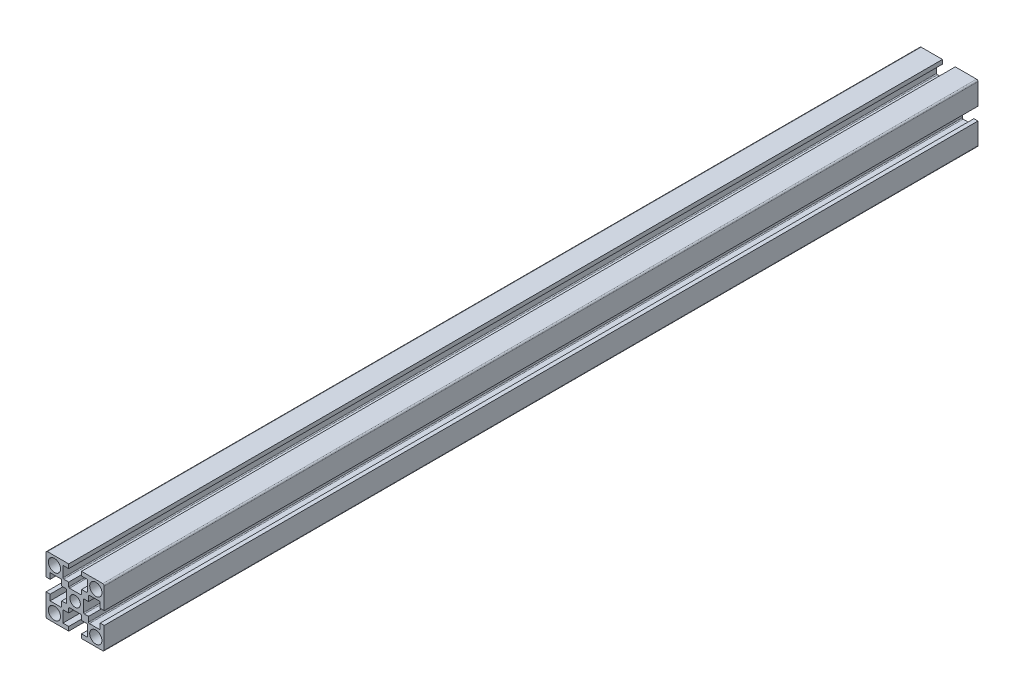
ISO-10303-21;
HEADER;
FILE_DESCRIPTION(('STEP AP214'),'2;1');
FILE_NAME('part.step','',(''),(''),'','','');
FILE_SCHEMA(('AUTOMOTIVE_DESIGN { 1 0 10303 214 1 1 1 1 }'));
ENDSEC;
DATA;
#1=APPLICATION_CONTEXT('core data for automotive mechanical design processes');
#2=APPLICATION_PROTOCOL_DEFINITION('international standard','automotive_design',2000,#1);
#3=PRODUCT_CONTEXT('',#1,'mechanical');
#4=PRODUCT('Part','Part','',(#3));
#5=PRODUCT_RELATED_PRODUCT_CATEGORY('part','',(#4));
#6=PRODUCT_DEFINITION_FORMATION('','',#4);
#7=PRODUCT_DEFINITION_CONTEXT('part definition',#1,'design');
#8=PRODUCT_DEFINITION('design','',#6,#7);
#9=PRODUCT_DEFINITION_SHAPE('','',#8);
#10=(LENGTH_UNIT() NAMED_UNIT(*) SI_UNIT(.MILLI.,.METRE.));
#11=(NAMED_UNIT(*) PLANE_ANGLE_UNIT() SI_UNIT($,.RADIAN.));
#12=(NAMED_UNIT(*) SI_UNIT($,.STERADIAN.) SOLID_ANGLE_UNIT());
#13=UNCERTAINTY_MEASURE_WITH_UNIT(LENGTH_MEASURE(1.E-05),#10,'distance_accuracy_value','');
#14=(GEOMETRIC_REPRESENTATION_CONTEXT(3) GLOBAL_UNCERTAINTY_ASSIGNED_CONTEXT((#13)) GLOBAL_UNIT_ASSIGNED_CONTEXT((#10,
#11,#12)) REPRESENTATION_CONTEXT('',''));
#15=CARTESIAN_POINT('',(0.,0.,0.));
#16=DIRECTION('',(0.,0.,1.));
#17=DIRECTION('',(1.,0.,0.));
#18=AXIS2_PLACEMENT_3D('',#15,#16,#17);
#19=CARTESIAN_POINT('',(1.90000000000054,-3.19999999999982,150.));
#20=DIRECTION('',(0.,0.,1.));
#21=DIRECTION('',(1.,0.,0.));
#22=AXIS2_PLACEMENT_3D('',#19,#20,#21);
#23=PLANE('',#22);
#24=CARTESIAN_POINT('',(-7.09999999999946,-7.10000000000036,150.));
#25=DIRECTION('',(0.,0.,1.));
#26=DIRECTION('',(1.,0.,0.));
#27=AXIS2_PLACEMENT_3D('',#24,#25,#26);
#28=CIRCLE('',#27,2.1);
#29=CARTESIAN_POINT('',(-4.99999999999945,-7.10000000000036,150.));
#30=VERTEX_POINT('',#29);
#31=EDGE_CURVE('E1078',#30,#30,#28,.T.);
#32=ORIENTED_EDGE('',*,*,#31,.F.);
#33=EDGE_LOOP('',(#32));
#34=FACE_BOUND('',#33,.T.);
#35=CARTESIAN_POINT('',(7.10000000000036,-7.10000000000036,150.));
#36=DIRECTION('',(0.,0.,1.));
#37=DIRECTION('',(1.,0.,0.));
#38=AXIS2_PLACEMENT_3D('',#35,#36,#37);
#39=CIRCLE('',#38,2.1);
#40=CARTESIAN_POINT('',(9.20000000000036,-7.10000000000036,150.));
#41=VERTEX_POINT('',#40);
#42=EDGE_CURVE('E1090',#41,#41,#39,.T.);
#43=ORIENTED_EDGE('',*,*,#42,.F.);
#44=EDGE_LOOP('',(#43));
#45=FACE_BOUND('',#44,.T.);
#46=CARTESIAN_POINT('',(1.90000000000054,-3.19999999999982,150.));
#47=DIRECTION('',(0.,0.,-1.));
#48=DIRECTION('',(1.,0.,0.));
#49=AXIS2_PLACEMENT_3D('',#46,#47,#48);
#50=CIRCLE('',#49,0.299999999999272);
#51=CARTESIAN_POINT('',(1.90000000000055,-2.90000000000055,150.));
#52=VERTEX_POINT('',#51);
#53=CARTESIAN_POINT('',(2.19999999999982,-3.19999999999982,150.));
#54=VERTEX_POINT('',#53);
#55=EDGE_CURVE('E659',#52,#54,#50,.T.);
#56=ORIENTED_EDGE('',*,*,#55,.T.);
#57=DIRECTION('',(0.,-1.,0.));
#58=VECTOR('',#57,1.);
#59=CARTESIAN_POINT('',(2.19999999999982,-3.19999999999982,150.));
#60=LINE('',#59,#58);
#61=CARTESIAN_POINT('',(2.19999999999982,-4.60000000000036,150.));
#62=VERTEX_POINT('',#61);
#63=EDGE_CURVE('E287',#54,#62,#60,.T.);
#64=ORIENTED_EDGE('',*,*,#63,.T.);
#65=DIRECTION('',(1.,0.,0.));
#66=VECTOR('',#65,1.);
#67=CARTESIAN_POINT('',(2.19999999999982,-4.60000000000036,150.));
#68=LINE('',#67,#66);
#69=CARTESIAN_POINT('',(3.90000000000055,-4.60000000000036,150.));
#70=VERTEX_POINT('',#69);
#71=EDGE_CURVE('E866',#62,#70,#68,.T.);
#72=ORIENTED_EDGE('',*,*,#71,.T.);
#73=CARTESIAN_POINT('',(3.90000000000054,-4.90000000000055,150.));
#74=DIRECTION('',(0.,0.,-1.));
#75=DIRECTION('',(1.,0.,0.));
#76=AXIS2_PLACEMENT_3D('',#73,#74,#75);
#77=CIRCLE('',#76,0.300000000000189);
#78=CARTESIAN_POINT('',(4.20000000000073,-4.90000000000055,150.));
#79=VERTEX_POINT('',#78);
#80=EDGE_CURVE('E885',#70,#79,#77,.T.);
#81=ORIENTED_EDGE('',*,*,#80,.T.);
#82=DIRECTION('',(0.,-1.,0.));
#83=VECTOR('',#82,1.);
#84=CARTESIAN_POINT('',(4.20000000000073,-4.90000000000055,150.));
#85=LINE('',#84,#83);
#86=CARTESIAN_POINT('',(4.20000000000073,-8.60000000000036,150.));
#87=VERTEX_POINT('',#86);
#88=EDGE_CURVE('E882',#79,#87,#85,.T.);
#89=ORIENTED_EDGE('',*,*,#88,.T.);
#90=DIRECTION('',(-1.,0.,0.));
#91=VECTOR('',#90,1.);
#92=CARTESIAN_POINT('',(4.20000000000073,-8.60000000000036,150.));
#93=LINE('',#92,#91);
#94=CARTESIAN_POINT('',(2.19999999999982,-8.60000000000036,150.));
#95=VERTEX_POINT('',#94);
#96=EDGE_CURVE('E884',#87,#95,#93,.T.);
#97=ORIENTED_EDGE('',*,*,#96,.T.);
#98=DIRECTION('',(0.,-1.,0.));
#99=VECTOR('',#98,1.);
#100=CARTESIAN_POINT('',(2.19999999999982,-8.60000000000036,150.));
#101=LINE('',#100,#99);
#102=CARTESIAN_POINT('',(2.19999999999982,-10.,150.));
#103=VERTEX_POINT('',#102);
#104=EDGE_CURVE('E887',#95,#103,#101,.T.);
#105=ORIENTED_EDGE('',*,*,#104,.T.);
#106=DIRECTION('',(1.,0.,0.));
#107=VECTOR('',#106,1.);
#108=CARTESIAN_POINT('',(2.19999999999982,-10.,150.));
#109=LINE('',#108,#107);
#110=CARTESIAN_POINT('',(9.5,-10.,150.));
#111=VERTEX_POINT('',#110);
#112=EDGE_CURVE('E893',#103,#111,#109,.T.);
#113=ORIENTED_EDGE('',*,*,#112,.T.);
#114=CARTESIAN_POINT('',(9.5,-9.5,150.));
#115=DIRECTION('',(0.,0.,1.));
#116=DIRECTION('',(1.,0.,0.));
#117=AXIS2_PLACEMENT_3D('',#114,#115,#116);
#118=CIRCLE('',#117,0.5);
#119=CARTESIAN_POINT('',(10.,-9.5,150.));
#120=VERTEX_POINT('',#119);
#121=EDGE_CURVE('E895',#111,#120,#118,.T.);
#122=ORIENTED_EDGE('',*,*,#121,.T.);
#123=DIRECTION('',(0.,1.,0.));
#124=VECTOR('',#123,1.);
#125=CARTESIAN_POINT('',(10.,-9.5,150.));
#126=LINE('',#125,#124);
#127=CARTESIAN_POINT('',(10.,-2.19999999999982,150.));
#128=VERTEX_POINT('',#127);
#129=EDGE_CURVE('E897',#120,#128,#126,.T.);
#130=ORIENTED_EDGE('',*,*,#129,.T.);
#131=DIRECTION('',(-1.,0.,0.));
#132=VECTOR('',#131,1.);
#133=CARTESIAN_POINT('',(10.,-2.19999999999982,150.));
#134=LINE('',#133,#132);
#135=CARTESIAN_POINT('',(8.60000000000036,-2.19999999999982,150.));
#136=VERTEX_POINT('',#135);
#137=EDGE_CURVE('E899',#128,#136,#134,.T.);
#138=ORIENTED_EDGE('',*,*,#137,.T.);
#139=DIRECTION('',(0.,-1.,0.));
#140=VECTOR('',#139,1.);
#141=CARTESIAN_POINT('',(8.60000000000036,-2.19999999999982,150.));
#142=LINE('',#141,#140);
#143=CARTESIAN_POINT('',(8.60000000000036,-4.19999999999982,150.));
#144=VERTEX_POINT('',#143);
#145=EDGE_CURVE('E901',#136,#144,#142,.T.);
#146=ORIENTED_EDGE('',*,*,#145,.T.);
#147=DIRECTION('',(-1.,0.,0.));
#148=VECTOR('',#147,1.);
#149=CARTESIAN_POINT('',(8.60000000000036,-4.19999999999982,150.));
#150=LINE('',#149,#148);
#151=CARTESIAN_POINT('',(4.90000000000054,-4.19999999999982,150.));
#152=VERTEX_POINT('',#151);
#153=EDGE_CURVE('E903',#144,#152,#150,.T.);
#154=ORIENTED_EDGE('',*,*,#153,.T.);
#155=CARTESIAN_POINT('',(4.9000000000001,-3.90000000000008,150.));
#156=DIRECTION('',(0.,0.,-1.));
#157=DIRECTION('',(1.,0.,0.));
#158=AXIS2_PLACEMENT_3D('',#155,#156,#157);
#159=CIRCLE('',#158,0.299999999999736);
#160=CARTESIAN_POINT('',(4.60000000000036,-3.90000000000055,150.));
#161=VERTEX_POINT('',#160);
#162=EDGE_CURVE('E905',#152,#161,#159,.T.);
#163=ORIENTED_EDGE('',*,*,#162,.T.);
#164=DIRECTION('',(0.,1.,0.));
#165=VECTOR('',#164,1.);
#166=CARTESIAN_POINT('',(4.60000000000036,-3.90000000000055,150.));
#167=LINE('',#166,#165);
#168=CARTESIAN_POINT('',(4.60000000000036,-2.19999999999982,150.));
#169=VERTEX_POINT('',#168);
#170=EDGE_CURVE('E907',#161,#169,#167,.T.);
#171=ORIENTED_EDGE('',*,*,#170,.T.);
#172=DIRECTION('',(-1.,0.,0.));
#173=VECTOR('',#172,1.);
#174=CARTESIAN_POINT('',(4.60000000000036,-2.19999999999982,150.));
#175=LINE('',#174,#173);
#176=CARTESIAN_POINT('',(3.19999999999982,-2.19999999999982,150.));
#177=VERTEX_POINT('',#176);
#178=EDGE_CURVE('E909',#169,#177,#175,.T.);
#179=ORIENTED_EDGE('',*,*,#178,.T.);
#180=CARTESIAN_POINT('',(3.19999999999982,-1.90000000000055,150.));
#181=DIRECTION('',(0.,0.,-1.));
#182=DIRECTION('',(1.,0.,0.));
#183=AXIS2_PLACEMENT_3D('',#180,#181,#182);
#184=CIRCLE('',#183,0.299999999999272);
#185=CARTESIAN_POINT('',(2.90000000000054,-1.90000000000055,150.));
#186=VERTEX_POINT('',#185);
#187=EDGE_CURVE('E911',#177,#186,#184,.T.);
#188=ORIENTED_EDGE('',*,*,#187,.T.);
#189=DIRECTION('',(0.,1.,0.));
#190=VECTOR('',#189,1.);
#191=CARTESIAN_POINT('',(2.90000000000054,-1.90000000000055,150.));
#192=LINE('',#191,#190);
#193=CARTESIAN_POINT('',(2.90000000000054,1.89999999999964,150.));
#194=VERTEX_POINT('',#193);
#195=EDGE_CURVE('E913',#186,#194,#192,.T.);
#196=ORIENTED_EDGE('',*,*,#195,.T.);
#197=CARTESIAN_POINT('',(3.20000000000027,1.90000000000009,150.));
#198=DIRECTION('',(0.,0.,-1.));
#199=DIRECTION('',(1.,0.,0.));
#200=AXIS2_PLACEMENT_3D('',#197,#198,#199);
#201=CIRCLE('',#200,0.299999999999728);
#202=CARTESIAN_POINT('',(3.19999999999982,2.19999999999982,150.));
#203=VERTEX_POINT('',#202);
#204=EDGE_CURVE('E915',#194,#203,#201,.T.);
#205=ORIENTED_EDGE('',*,*,#204,.T.);
#206=DIRECTION('',(1.,0.,0.));
#207=VECTOR('',#206,1.);
#208=CARTESIAN_POINT('',(3.19999999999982,2.19999999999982,150.));
#209=LINE('',#208,#207);
#210=CARTESIAN_POINT('',(4.60000000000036,2.19999999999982,150.));
#211=VERTEX_POINT('',#210);
#212=EDGE_CURVE('E917',#203,#211,#209,.T.);
#213=ORIENTED_EDGE('',*,*,#212,.T.);
#214=DIRECTION('',(0.,1.,0.));
#215=VECTOR('',#214,1.);
#216=CARTESIAN_POINT('',(4.60000000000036,2.19999999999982,150.));
#217=LINE('',#216,#215);
#218=CARTESIAN_POINT('',(4.60000000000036,3.89999999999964,150.));
#219=VERTEX_POINT('',#218);
#220=EDGE_CURVE('E919',#211,#219,#217,.T.);
#221=ORIENTED_EDGE('',*,*,#220,.T.);
#222=CARTESIAN_POINT('',(4.90000000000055,3.89999999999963,150.));
#223=DIRECTION('',(0.,0.,-1.));
#224=DIRECTION('',(1.,0.,0.));
#225=AXIS2_PLACEMENT_3D('',#222,#223,#224);
#226=CIRCLE('',#225,0.300000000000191);
#227=CARTESIAN_POINT('',(4.90000000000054,4.19999999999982,150.));
#228=VERTEX_POINT('',#227);
#229=EDGE_CURVE('E921',#219,#228,#226,.T.);
#230=ORIENTED_EDGE('',*,*,#229,.T.);
#231=DIRECTION('',(1.,0.,0.));
#232=VECTOR('',#231,1.);
#233=CARTESIAN_POINT('',(4.90000000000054,4.19999999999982,150.));
#234=LINE('',#233,#232);
#235=CARTESIAN_POINT('',(8.60000000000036,4.19999999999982,150.));
#236=VERTEX_POINT('',#235);
#237=EDGE_CURVE('E923',#228,#236,#234,.T.);
#238=ORIENTED_EDGE('',*,*,#237,.T.);
#239=DIRECTION('',(0.,-1.,0.));
#240=VECTOR('',#239,1.);
#241=CARTESIAN_POINT('',(8.60000000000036,4.19999999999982,150.));
#242=LINE('',#241,#240);
#243=CARTESIAN_POINT('',(8.60000000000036,2.19999999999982,150.));
#244=VERTEX_POINT('',#243);
#245=EDGE_CURVE('E925',#236,#244,#242,.T.);
#246=ORIENTED_EDGE('',*,*,#245,.T.);
#247=DIRECTION('',(1.,0.,0.));
#248=VECTOR('',#247,1.);
#249=CARTESIAN_POINT('',(8.60000000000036,2.19999999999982,150.));
#250=LINE('',#249,#248);
#251=CARTESIAN_POINT('',(10.,2.19999999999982,150.));
#252=VERTEX_POINT('',#251);
#253=EDGE_CURVE('E927',#244,#252,#250,.T.);
#254=ORIENTED_EDGE('',*,*,#253,.T.);
#255=DIRECTION('',(0.,1.,0.));
#256=VECTOR('',#255,1.);
#257=CARTESIAN_POINT('',(10.,2.19999999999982,150.));
#258=LINE('',#257,#256);
#259=CARTESIAN_POINT('',(10.,9.49999999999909,150.));
#260=VERTEX_POINT('',#259);
#261=EDGE_CURVE('E929',#252,#260,#258,.T.);
#262=ORIENTED_EDGE('',*,*,#261,.T.);
#263=CARTESIAN_POINT('',(9.5,9.49999999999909,150.));
#264=DIRECTION('',(0.,0.,1.));
#265=DIRECTION('',(1.,0.,0.));
#266=AXIS2_PLACEMENT_3D('',#263,#264,#265);
#267=CIRCLE('',#266,0.5);
#268=CARTESIAN_POINT('',(9.5,9.99999999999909,150.));
#269=VERTEX_POINT('',#268);
#270=EDGE_CURVE('E931',#260,#269,#267,.T.);
#271=ORIENTED_EDGE('',*,*,#270,.T.);
#272=DIRECTION('',(-1.,0.,0.));
#273=VECTOR('',#272,1.);
#274=CARTESIAN_POINT('',(9.5,9.99999999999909,150.));
#275=LINE('',#274,#273);
#276=CARTESIAN_POINT('',(2.19999999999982,9.99999999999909,150.));
#277=VERTEX_POINT('',#276);
#278=EDGE_CURVE('E933',#269,#277,#275,.T.);
#279=ORIENTED_EDGE('',*,*,#278,.T.);
#280=DIRECTION('',(0.,-1.,0.));
#281=VECTOR('',#280,1.);
#282=CARTESIAN_POINT('',(2.19999999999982,9.99999999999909,150.));
#283=LINE('',#282,#281);
#284=CARTESIAN_POINT('',(2.19999999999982,8.59999999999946,150.));
#285=VERTEX_POINT('',#284);
#286=EDGE_CURVE('E935',#277,#285,#283,.T.);
#287=ORIENTED_EDGE('',*,*,#286,.T.);
#288=DIRECTION('',(1.,0.,0.));
#289=VECTOR('',#288,1.);
#290=CARTESIAN_POINT('',(2.19999999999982,8.59999999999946,150.));
#291=LINE('',#290,#289);
#292=CARTESIAN_POINT('',(4.20000000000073,8.59999999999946,150.));
#293=VERTEX_POINT('',#292);
#294=EDGE_CURVE('E937',#285,#293,#291,.T.);
#295=ORIENTED_EDGE('',*,*,#294,.T.);
#296=DIRECTION('',(0.,-1.,0.));
#297=VECTOR('',#296,1.);
#298=CARTESIAN_POINT('',(4.20000000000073,8.59999999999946,150.));
#299=LINE('',#298,#297);
#300=CARTESIAN_POINT('',(4.20000000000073,4.89999999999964,150.));
#301=VERTEX_POINT('',#300);
#302=EDGE_CURVE('E939',#293,#301,#299,.T.);
#303=ORIENTED_EDGE('',*,*,#302,.T.);
#304=CARTESIAN_POINT('',(3.90000000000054,4.89999999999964,150.));
#305=DIRECTION('',(0.,0.,-1.));
#306=DIRECTION('',(1.,0.,0.));
#307=AXIS2_PLACEMENT_3D('',#304,#305,#306);
#308=CIRCLE('',#307,0.300000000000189);
#309=CARTESIAN_POINT('',(3.90000000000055,4.59999999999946,150.));
#310=VERTEX_POINT('',#309);
#311=EDGE_CURVE('E941',#301,#310,#308,.T.);
#312=ORIENTED_EDGE('',*,*,#311,.T.);
#313=DIRECTION('',(-1.,0.,0.));
#314=VECTOR('',#313,1.);
#315=CARTESIAN_POINT('',(3.90000000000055,4.59999999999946,150.));
#316=LINE('',#315,#314);
#317=CARTESIAN_POINT('',(2.19999999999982,4.59999999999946,150.));
#318=VERTEX_POINT('',#317);
#319=EDGE_CURVE('E943',#310,#318,#316,.T.);
#320=ORIENTED_EDGE('',*,*,#319,.T.);
#321=DIRECTION('',(0.,-1.,0.));
#322=VECTOR('',#321,1.);
#323=CARTESIAN_POINT('',(2.19999999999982,4.59999999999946,150.));
#324=LINE('',#323,#322);
#325=CARTESIAN_POINT('',(2.19999999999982,3.19999999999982,150.));
#326=VERTEX_POINT('',#325);
#327=EDGE_CURVE('E945',#318,#326,#324,.T.);
#328=ORIENTED_EDGE('',*,*,#327,.T.);
#329=CARTESIAN_POINT('',(1.90000000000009,3.19999999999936,150.));
#330=DIRECTION('',(0.,0.,-1.));
#331=DIRECTION('',(1.,0.,0.));
#332=AXIS2_PLACEMENT_3D('',#329,#330,#331);
#333=CIRCLE('',#332,0.299999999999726);
#334=CARTESIAN_POINT('',(1.90000000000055,2.89999999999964,150.));
#335=VERTEX_POINT('',#334);
#336=EDGE_CURVE('E947',#326,#335,#333,.T.);
#337=ORIENTED_EDGE('',*,*,#336,.T.);
#338=DIRECTION('',(-1.,0.,0.));
#339=VECTOR('',#338,1.);
#340=CARTESIAN_POINT('',(1.90000000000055,2.89999999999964,150.));
#341=LINE('',#340,#339);
#342=CARTESIAN_POINT('',(-1.89999999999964,2.89999999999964,150.));
#343=VERTEX_POINT('',#342);
#344=EDGE_CURVE('E949',#335,#343,#341,.T.);
#345=ORIENTED_EDGE('',*,*,#344,.T.);
#346=CARTESIAN_POINT('',(-1.89999999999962,3.19999999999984,150.));
#347=DIRECTION('',(0.,0.,-1.));
#348=DIRECTION('',(1.,0.,0.));
#349=AXIS2_PLACEMENT_3D('',#346,#347,#348);
#350=CIRCLE('',#349,0.3000000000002);
#351=CARTESIAN_POINT('',(-2.19999999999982,3.19999999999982,150.));
#352=VERTEX_POINT('',#351);
#353=EDGE_CURVE('E951',#343,#352,#350,.T.);
#354=ORIENTED_EDGE('',*,*,#353,.T.);
#355=DIRECTION('',(0.,1.,0.));
#356=VECTOR('',#355,1.);
#357=CARTESIAN_POINT('',(-2.19999999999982,3.19999999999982,150.));
#358=LINE('',#357,#356);
#359=CARTESIAN_POINT('',(-2.19999999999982,4.59999999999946,150.));
#360=VERTEX_POINT('',#359);
#361=EDGE_CURVE('E953',#352,#360,#358,.T.);
#362=ORIENTED_EDGE('',*,*,#361,.T.);
#363=DIRECTION('',(-1.,0.,0.));
#364=VECTOR('',#363,1.);
#365=CARTESIAN_POINT('',(-2.19999999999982,4.59999999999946,150.));
#366=LINE('',#365,#364);
#367=CARTESIAN_POINT('',(-3.89999999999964,4.59999999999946,150.));
#368=VERTEX_POINT('',#367);
#369=EDGE_CURVE('E955',#360,#368,#366,.T.);
#370=ORIENTED_EDGE('',*,*,#369,.T.);
#371=CARTESIAN_POINT('',(-3.89999999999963,4.89999999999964,150.));
#372=DIRECTION('',(0.,0.,-1.));
#373=DIRECTION('',(1.,0.,0.));
#374=AXIS2_PLACEMENT_3D('',#371,#372,#373);
#375=CIRCLE('',#374,0.300000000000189);
#376=CARTESIAN_POINT('',(-4.19999999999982,4.89999999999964,150.));
#377=VERTEX_POINT('',#376);
#378=EDGE_CURVE('E957',#368,#377,#375,.T.);
#379=ORIENTED_EDGE('',*,*,#378,.T.);
#380=DIRECTION('',(0.,1.,0.));
#381=VECTOR('',#380,1.);
#382=CARTESIAN_POINT('',(-4.19999999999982,4.89999999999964,150.));
#383=LINE('',#382,#381);
#384=CARTESIAN_POINT('',(-4.19999999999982,8.59999999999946,150.));
#385=VERTEX_POINT('',#384);
#386=EDGE_CURVE('E959',#377,#385,#383,.T.);
#387=ORIENTED_EDGE('',*,*,#386,.T.);
#388=DIRECTION('',(1.,0.,0.));
#389=VECTOR('',#388,1.);
#390=CARTESIAN_POINT('',(-4.19999999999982,8.59999999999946,150.));
#391=LINE('',#390,#389);
#392=CARTESIAN_POINT('',(-2.19999999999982,8.59999999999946,150.));
#393=VERTEX_POINT('',#392);
#394=EDGE_CURVE('E961',#385,#393,#391,.T.);
#395=ORIENTED_EDGE('',*,*,#394,.T.);
#396=DIRECTION('',(0.,1.,0.));
#397=VECTOR('',#396,1.);
#398=CARTESIAN_POINT('',(-2.19999999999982,8.59999999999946,150.));
#399=LINE('',#398,#397);
#400=CARTESIAN_POINT('',(-2.19999999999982,9.99999999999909,150.));
#401=VERTEX_POINT('',#400);
#402=EDGE_CURVE('E963',#393,#401,#399,.T.);
#403=ORIENTED_EDGE('',*,*,#402,.T.);
#404=DIRECTION('',(-1.,0.,0.));
#405=VECTOR('',#404,1.);
#406=CARTESIAN_POINT('',(-2.19999999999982,9.99999999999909,150.));
#407=LINE('',#406,#405);
#408=CARTESIAN_POINT('',(-9.5,9.99999999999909,150.));
#409=VERTEX_POINT('',#408);
#410=EDGE_CURVE('E965',#401,#409,#407,.T.);
#411=ORIENTED_EDGE('',*,*,#410,.T.);
#412=CARTESIAN_POINT('',(-9.5,9.49999999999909,150.));
#413=DIRECTION('',(0.,0.,1.));
#414=DIRECTION('',(1.,0.,0.));
#415=AXIS2_PLACEMENT_3D('',#412,#413,#414);
#416=CIRCLE('',#415,0.5);
#417=CARTESIAN_POINT('',(-10.,9.49999999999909,150.));
#418=VERTEX_POINT('',#417);
#419=EDGE_CURVE('E967',#409,#418,#416,.T.);
#420=ORIENTED_EDGE('',*,*,#419,.T.);
#421=DIRECTION('',(0.,-1.,0.));
#422=VECTOR('',#421,1.);
#423=CARTESIAN_POINT('',(-10.,9.49999999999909,150.));
#424=LINE('',#423,#422);
#425=CARTESIAN_POINT('',(-10.,2.19999999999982,150.));
#426=VERTEX_POINT('',#425);
#427=EDGE_CURVE('E969',#418,#426,#424,.T.);
#428=ORIENTED_EDGE('',*,*,#427,.T.);
#429=DIRECTION('',(1.,0.,0.));
#430=VECTOR('',#429,1.);
#431=CARTESIAN_POINT('',(-10.,2.19999999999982,150.));
#432=LINE('',#431,#430);
#433=CARTESIAN_POINT('',(-8.59999999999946,2.19999999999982,150.));
#434=VERTEX_POINT('',#433);
#435=EDGE_CURVE('E971',#426,#434,#432,.T.);
#436=ORIENTED_EDGE('',*,*,#435,.T.);
#437=DIRECTION('',(0.,1.,0.));
#438=VECTOR('',#437,1.);
#439=CARTESIAN_POINT('',(-8.59999999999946,2.19999999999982,150.));
#440=LINE('',#439,#438);
#441=CARTESIAN_POINT('',(-8.59999999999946,4.19999999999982,150.));
#442=VERTEX_POINT('',#441);
#443=EDGE_CURVE('E973',#434,#442,#440,.T.);
#444=ORIENTED_EDGE('',*,*,#443,.T.);
#445=DIRECTION('',(1.,0.,0.));
#446=VECTOR('',#445,1.);
#447=CARTESIAN_POINT('',(-8.59999999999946,4.19999999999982,150.));
#448=LINE('',#447,#446);
#449=CARTESIAN_POINT('',(-4.89999999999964,4.19999999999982,150.));
#450=VERTEX_POINT('',#449);
#451=EDGE_CURVE('E975',#442,#450,#448,.T.);
#452=ORIENTED_EDGE('',*,*,#451,.T.);
#453=CARTESIAN_POINT('',(-4.89999999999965,3.89999999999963,150.));
#454=DIRECTION('',(0.,0.,-1.));
#455=DIRECTION('',(1.,0.,0.));
#456=AXIS2_PLACEMENT_3D('',#453,#454,#455);
#457=CIRCLE('',#456,0.300000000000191);
#458=CARTESIAN_POINT('',(-4.59999999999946,3.89999999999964,150.));
#459=VERTEX_POINT('',#458);
#460=EDGE_CURVE('E977',#450,#459,#457,.T.);
#461=ORIENTED_EDGE('',*,*,#460,.T.);
#462=DIRECTION('',(0.,-1.,0.));
#463=VECTOR('',#462,1.);
#464=CARTESIAN_POINT('',(-4.59999999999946,3.89999999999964,150.));
#465=LINE('',#464,#463);
#466=CARTESIAN_POINT('',(-4.59999999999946,2.19999999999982,150.));
#467=VERTEX_POINT('',#466);
#468=EDGE_CURVE('E979',#459,#467,#465,.T.);
#469=ORIENTED_EDGE('',*,*,#468,.T.);
#470=DIRECTION('',(1.,0.,0.));
#471=VECTOR('',#470,1.);
#472=CARTESIAN_POINT('',(-4.59999999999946,2.19999999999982,150.));
#473=LINE('',#472,#471);
#474=CARTESIAN_POINT('',(-3.19999999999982,2.19999999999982,150.));
#475=VERTEX_POINT('',#474);
#476=EDGE_CURVE('E981',#467,#475,#473,.T.);
#477=ORIENTED_EDGE('',*,*,#476,.T.);
#478=CARTESIAN_POINT('',(-3.19999999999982,1.89999999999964,150.));
#479=DIRECTION('',(0.,0.,-1.));
#480=DIRECTION('',(1.,0.,0.));
#481=AXIS2_PLACEMENT_3D('',#478,#479,#480);
#482=CIRCLE('',#481,0.300000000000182);
#483=CARTESIAN_POINT('',(-2.89999999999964,1.89999999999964,150.));
#484=VERTEX_POINT('',#483);
#485=EDGE_CURVE('E983',#475,#484,#482,.T.);
#486=ORIENTED_EDGE('',*,*,#485,.T.);
#487=DIRECTION('',(0.,-1.,0.));
#488=VECTOR('',#487,1.);
#489=CARTESIAN_POINT('',(-2.89999999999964,1.89999999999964,150.));
#490=LINE('',#489,#488);
#491=CARTESIAN_POINT('',(-2.89999999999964,-1.90000000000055,150.));
#492=VERTEX_POINT('',#491);
#493=EDGE_CURVE('E985',#484,#492,#490,.T.);
#494=ORIENTED_EDGE('',*,*,#493,.T.);
#495=CARTESIAN_POINT('',(-3.19999999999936,-1.90000000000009,150.));
#496=DIRECTION('',(0.,0.,-1.));
#497=DIRECTION('',(1.,0.,0.));
#498=AXIS2_PLACEMENT_3D('',#495,#496,#497);
#499=CIRCLE('',#498,0.299999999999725);
#500=CARTESIAN_POINT('',(-3.19999999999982,-2.19999999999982,150.));
#501=VERTEX_POINT('',#500);
#502=EDGE_CURVE('E987',#492,#501,#499,.T.);
#503=ORIENTED_EDGE('',*,*,#502,.T.);
#504=DIRECTION('',(-1.,0.,0.));
#505=VECTOR('',#504,1.);
#506=CARTESIAN_POINT('',(-3.19999999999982,-2.19999999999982,150.));
#507=LINE('',#506,#505);
#508=CARTESIAN_POINT('',(-4.59999999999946,-2.19999999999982,150.));
#509=VERTEX_POINT('',#508);
#510=EDGE_CURVE('E989',#501,#509,#507,.T.);
#511=ORIENTED_EDGE('',*,*,#510,.T.);
#512=DIRECTION('',(0.,-1.,0.));
#513=VECTOR('',#512,1.);
#514=CARTESIAN_POINT('',(-4.59999999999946,-2.19999999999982,150.));
#515=LINE('',#514,#513);
#516=CARTESIAN_POINT('',(-4.59999999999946,-3.90000000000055,150.));
#517=VERTEX_POINT('',#516);
#518=EDGE_CURVE('E991',#509,#517,#515,.T.);
#519=ORIENTED_EDGE('',*,*,#518,.T.);
#520=CARTESIAN_POINT('',(-4.89999999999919,-3.90000000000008,150.));
#521=DIRECTION('',(0.,0.,-1.));
#522=DIRECTION('',(1.,0.,0.));
#523=AXIS2_PLACEMENT_3D('',#520,#521,#522);
#524=CIRCLE('',#523,0.299999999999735);
#525=CARTESIAN_POINT('',(-4.89999999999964,-4.19999999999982,150.));
#526=VERTEX_POINT('',#525);
#527=EDGE_CURVE('E993',#517,#526,#524,.T.);
#528=ORIENTED_EDGE('',*,*,#527,.T.);
#529=DIRECTION('',(-1.,0.,0.));
#530=VECTOR('',#529,1.);
#531=CARTESIAN_POINT('',(-4.89999999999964,-4.19999999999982,150.));
#532=LINE('',#531,#530);
#533=CARTESIAN_POINT('',(-8.59999999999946,-4.19999999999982,150.));
#534=VERTEX_POINT('',#533);
#535=EDGE_CURVE('E995',#526,#534,#532,.T.);
#536=ORIENTED_EDGE('',*,*,#535,.T.);
#537=DIRECTION('',(0.,1.,0.));
#538=VECTOR('',#537,1.);
#539=CARTESIAN_POINT('',(-8.59999999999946,-4.19999999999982,150.));
#540=LINE('',#539,#538);
#541=CARTESIAN_POINT('',(-8.59999999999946,-2.19999999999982,150.));
#542=VERTEX_POINT('',#541);
#543=EDGE_CURVE('E997',#534,#542,#540,.T.);
#544=ORIENTED_EDGE('',*,*,#543,.T.);
#545=DIRECTION('',(-1.,0.,0.));
#546=VECTOR('',#545,1.);
#547=CARTESIAN_POINT('',(-8.59999999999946,-2.19999999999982,150.));
#548=LINE('',#547,#546);
#549=CARTESIAN_POINT('',(-10.,-2.19999999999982,150.));
#550=VERTEX_POINT('',#549);
#551=EDGE_CURVE('E999',#542,#550,#548,.T.);
#552=ORIENTED_EDGE('',*,*,#551,.T.);
#553=DIRECTION('',(0.,-1.,0.));
#554=VECTOR('',#553,1.);
#555=CARTESIAN_POINT('',(-10.,-2.19999999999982,150.));
#556=LINE('',#555,#554);
#557=CARTESIAN_POINT('',(-10.,-9.5,150.));
#558=VERTEX_POINT('',#557);
#559=EDGE_CURVE('E1001',#550,#558,#556,.T.);
#560=ORIENTED_EDGE('',*,*,#559,.T.);
#561=CARTESIAN_POINT('',(-9.5,-9.5,150.));
#562=DIRECTION('',(0.,0.,1.));
#563=DIRECTION('',(1.,0.,0.));
#564=AXIS2_PLACEMENT_3D('',#561,#562,#563);
#565=CIRCLE('',#564,0.5);
#566=CARTESIAN_POINT('',(-9.5,-10.,150.));
#567=VERTEX_POINT('',#566);
#568=EDGE_CURVE('E1003',#558,#567,#565,.T.);
#569=ORIENTED_EDGE('',*,*,#568,.T.);
#570=DIRECTION('',(1.,0.,0.));
#571=VECTOR('',#570,1.);
#572=CARTESIAN_POINT('',(-9.5,-10.,150.));
#573=LINE('',#572,#571);
#574=CARTESIAN_POINT('',(-2.19999999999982,-10.,150.));
#575=VERTEX_POINT('',#574);
#576=EDGE_CURVE('E1005',#567,#575,#573,.T.);
#577=ORIENTED_EDGE('',*,*,#576,.T.);
#578=DIRECTION('',(0.,1.,0.));
#579=VECTOR('',#578,1.);
#580=CARTESIAN_POINT('',(-2.19999999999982,-10.,150.));
#581=LINE('',#580,#579);
#582=CARTESIAN_POINT('',(-2.19999999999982,-8.60000000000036,150.));
#583=VERTEX_POINT('',#582);
#584=EDGE_CURVE('E1007',#575,#583,#581,.T.);
#585=ORIENTED_EDGE('',*,*,#584,.T.);
#586=DIRECTION('',(-1.,0.,0.));
#587=VECTOR('',#586,1.);
#588=CARTESIAN_POINT('',(-2.19999999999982,-8.60000000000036,150.));
#589=LINE('',#588,#587);
#590=CARTESIAN_POINT('',(-4.19999999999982,-8.60000000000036,150.));
#591=VERTEX_POINT('',#590);
#592=EDGE_CURVE('E1009',#583,#591,#589,.T.);
#593=ORIENTED_EDGE('',*,*,#592,.T.);
#594=DIRECTION('',(0.,1.,0.));
#595=VECTOR('',#594,1.);
#596=CARTESIAN_POINT('',(-4.19999999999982,-8.60000000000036,150.));
#597=LINE('',#596,#595);
#598=CARTESIAN_POINT('',(-4.19999999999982,-4.90000000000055,150.));
#599=VERTEX_POINT('',#598);
#600=EDGE_CURVE('E1011',#591,#599,#597,.T.);
#601=ORIENTED_EDGE('',*,*,#600,.T.);
#602=CARTESIAN_POINT('',(-3.89999999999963,-4.90000000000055,150.));
#603=DIRECTION('',(0.,0.,-1.));
#604=DIRECTION('',(1.,0.,0.));
#605=AXIS2_PLACEMENT_3D('',#602,#603,#604);
#606=CIRCLE('',#605,0.300000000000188);
#607=CARTESIAN_POINT('',(-3.89999999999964,-4.60000000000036,150.));
#608=VERTEX_POINT('',#607);
#609=EDGE_CURVE('E1013',#599,#608,#606,.T.);
#610=ORIENTED_EDGE('',*,*,#609,.T.);
#611=DIRECTION('',(1.,0.,0.));
#612=VECTOR('',#611,1.);
#613=CARTESIAN_POINT('',(-3.89999999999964,-4.60000000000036,150.));
#614=LINE('',#613,#612);
#615=CARTESIAN_POINT('',(-2.19999999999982,-4.60000000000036,150.));
#616=VERTEX_POINT('',#615);
#617=EDGE_CURVE('E498',#608,#616,#614,.T.);
#618=ORIENTED_EDGE('',*,*,#617,.T.);
#619=DIRECTION('',(0.,1.,0.));
#620=VECTOR('',#619,1.);
#621=CARTESIAN_POINT('',(-2.19999999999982,-4.60000000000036,150.));
#622=LINE('',#621,#620);
#623=CARTESIAN_POINT('',(-2.19999999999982,-3.19999999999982,150.));
#624=VERTEX_POINT('',#623);
#625=EDGE_CURVE('E492',#616,#624,#622,.T.);
#626=ORIENTED_EDGE('',*,*,#625,.T.);
#627=CARTESIAN_POINT('',(-1.90000000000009,-3.20000000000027,150.));
#628=DIRECTION('',(0.,0.,-1.));
#629=DIRECTION('',(1.,0.,0.));
#630=AXIS2_PLACEMENT_3D('',#627,#628,#629);
#631=CIRCLE('',#630,0.299999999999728);
#632=CARTESIAN_POINT('',(-1.89999999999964,-2.90000000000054,150.));
#633=VERTEX_POINT('',#632);
#634=EDGE_CURVE('E496',#624,#633,#631,.T.);
#635=ORIENTED_EDGE('',*,*,#634,.T.);
#636=DIRECTION('',(1.,0.,0.));
#637=VECTOR('',#636,1.);
#638=CARTESIAN_POINT('',(-1.89999999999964,-2.90000000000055,150.));
#639=LINE('',#638,#637);
#640=EDGE_CURVE('E52',#633,#52,#639,.T.);
#641=ORIENTED_EDGE('',*,*,#640,.T.);
#642=EDGE_LOOP('',(#56,#64,#72,#81,#89,#97,#105,#113,#122,#130,#138,#146,#154,#163,#171,#179,
#188,#196,#205,#213,#221,#230,#238,#246,#254,#262,#271,#279,#287,#295,#303,#312,#320,#328,#337,
#345,#354,#362,#370,#379,#387,#395,#403,#411,#420,#428,#436,#444,#452,#461,#469,#477,#486,#494,
#503,#511,#519,#528,#536,#544,#552,#560,#569,#577,#585,#593,#601,#610,#618,#626,#635,#641));
#643=FACE_BOUND('',#642,.T.);
#644=CARTESIAN_POINT('',(7.10000000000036,7.09999999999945,150.));
#645=DIRECTION('',(0.,0.,1.));
#646=DIRECTION('',(1.,0.,0.));
#647=AXIS2_PLACEMENT_3D('',#644,#645,#646);
#648=CIRCLE('',#647,2.1);
#649=CARTESIAN_POINT('',(9.20000000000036,7.09999999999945,150.));
#650=VERTEX_POINT('',#649);
#651=EDGE_CURVE('E520',#650,#650,#648,.T.);
#652=ORIENTED_EDGE('',*,*,#651,.F.);
#653=EDGE_LOOP('',(#652));
#654=FACE_BOUND('',#653,.T.);
#655=CARTESIAN_POINT('',(0.,0.,150.));
#656=DIRECTION('',(0.,0.,1.));
#657=DIRECTION('',(1.,0.,0.));
#658=AXIS2_PLACEMENT_3D('',#655,#656,#657);
#659=CIRCLE('',#658,1.8);
#660=CARTESIAN_POINT('',(1.8,0.,150.));
#661=VERTEX_POINT('',#660);
#662=EDGE_CURVE('E1084',#661,#661,#659,.T.);
#663=ORIENTED_EDGE('',*,*,#662,.F.);
#664=EDGE_LOOP('',(#663));
#665=FACE_BOUND('',#664,.T.);
#666=CARTESIAN_POINT('',(-7.09999999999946,7.09999999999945,150.));
#667=DIRECTION('',(0.,0.,1.));
#668=DIRECTION('',(1.,0.,0.));
#669=AXIS2_PLACEMENT_3D('',#666,#667,#668);
#670=CIRCLE('',#669,2.1);
#671=CARTESIAN_POINT('',(-4.99999999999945,7.09999999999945,150.));
#672=VERTEX_POINT('',#671);
#673=EDGE_CURVE('E1069',#672,#672,#670,.T.);
#674=ORIENTED_EDGE('',*,*,#673,.F.);
#675=EDGE_LOOP('',(#674));
#676=FACE_BOUND('',#675,.T.);
#677=ADVANCED_FACE('F35',(#34,#45,#643,#654,#665,#676),#23,.T.);
#678=CARTESIAN_POINT('',(1.90000000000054,-3.19999999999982,-150.));
#679=DIRECTION('',(0.,0.,1.));
#680=DIRECTION('',(1.,0.,0.));
#681=AXIS2_PLACEMENT_3D('',#678,#679,#680);
#682=PLANE('',#681);
#683=CARTESIAN_POINT('',(-7.09999999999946,-7.10000000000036,-150.));
#684=DIRECTION('',(0.,0.,1.));
#685=DIRECTION('',(1.,0.,0.));
#686=AXIS2_PLACEMENT_3D('',#683,#684,#685);
#687=CIRCLE('',#686,2.1);
#688=CARTESIAN_POINT('',(-4.99999999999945,-7.10000000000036,-150.));
#689=VERTEX_POINT('',#688);
#690=EDGE_CURVE('E1075',#689,#689,#687,.T.);
#691=ORIENTED_EDGE('',*,*,#690,.T.);
#692=EDGE_LOOP('',(#691));
#693=FACE_BOUND('',#692,.T.);
#694=CARTESIAN_POINT('',(7.10000000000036,-7.10000000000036,-150.));
#695=DIRECTION('',(0.,0.,1.));
#696=DIRECTION('',(1.,0.,0.));
#697=AXIS2_PLACEMENT_3D('',#694,#695,#696);
#698=CIRCLE('',#697,2.1);
#699=CARTESIAN_POINT('',(9.20000000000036,-7.10000000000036,-150.));
#700=VERTEX_POINT('',#699);
#701=EDGE_CURVE('E1087',#700,#700,#698,.T.);
#702=ORIENTED_EDGE('',*,*,#701,.T.);
#703=EDGE_LOOP('',(#702));
#704=FACE_BOUND('',#703,.T.);
#705=CARTESIAN_POINT('',(1.90000000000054,-3.19999999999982,-150.));
#706=DIRECTION('',(0.,0.,-1.));
#707=DIRECTION('',(1.,0.,0.));
#708=AXIS2_PLACEMENT_3D('',#705,#706,#707);
#709=CIRCLE('',#708,0.299999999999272);
#710=CARTESIAN_POINT('',(1.90000000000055,-2.90000000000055,-150.));
#711=VERTEX_POINT('',#710);
#712=CARTESIAN_POINT('',(2.19999999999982,-3.19999999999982,-150.));
#713=VERTEX_POINT('',#712);
#714=EDGE_CURVE('E516',#711,#713,#709,.T.);
#715=ORIENTED_EDGE('',*,*,#714,.F.);
#716=DIRECTION('',(1.,0.,0.));
#717=VECTOR('',#716,1.);
#718=CARTESIAN_POINT('',(-1.89999999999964,-2.90000000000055,-150.));
#719=LINE('',#718,#717);
#720=CARTESIAN_POINT('',(-1.89999999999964,-2.90000000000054,-150.));
#721=VERTEX_POINT('',#720);
#722=EDGE_CURVE('E279',#721,#711,#719,.T.);
#723=ORIENTED_EDGE('',*,*,#722,.F.);
#724=CARTESIAN_POINT('',(-1.90000000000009,-3.20000000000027,-150.));
#725=DIRECTION('',(0.,0.,-1.));
#726=DIRECTION('',(1.,0.,0.));
#727=AXIS2_PLACEMENT_3D('',#724,#725,#726);
#728=CIRCLE('',#727,0.299999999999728);
#729=CARTESIAN_POINT('',(-2.19999999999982,-3.19999999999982,-150.));
#730=VERTEX_POINT('',#729);
#731=EDGE_CURVE('E273',#730,#721,#728,.T.);
#732=ORIENTED_EDGE('',*,*,#731,.F.);
#733=DIRECTION('',(0.,1.,0.));
#734=VECTOR('',#733,1.);
#735=CARTESIAN_POINT('',(-2.19999999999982,-4.60000000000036,-150.));
#736=LINE('',#735,#734);
#737=CARTESIAN_POINT('',(-2.19999999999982,-4.60000000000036,-150.));
#738=VERTEX_POINT('',#737);
#739=EDGE_CURVE('E506',#738,#730,#736,.T.);
#740=ORIENTED_EDGE('',*,*,#739,.F.);
#741=DIRECTION('',(1.,0.,0.));
#742=VECTOR('',#741,1.);
#743=CARTESIAN_POINT('',(-3.89999999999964,-4.60000000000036,-150.));
#744=LINE('',#743,#742);
#745=CARTESIAN_POINT('',(-3.89999999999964,-4.60000000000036,-150.));
#746=VERTEX_POINT('',#745);
#747=EDGE_CURVE('E654',#746,#738,#744,.T.);
#748=ORIENTED_EDGE('',*,*,#747,.F.);
#749=CARTESIAN_POINT('',(-3.89999999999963,-4.90000000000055,-150.));
#750=DIRECTION('',(0.,0.,-1.));
#751=DIRECTION('',(1.,0.,0.));
#752=AXIS2_PLACEMENT_3D('',#749,#750,#751);
#753=CIRCLE('',#752,0.300000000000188);
#754=CARTESIAN_POINT('',(-4.19999999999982,-4.90000000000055,-150.));
#755=VERTEX_POINT('',#754);
#756=EDGE_CURVE('E652',#755,#746,#753,.T.);
#757=ORIENTED_EDGE('',*,*,#756,.F.);
#758=DIRECTION('',(0.,1.,0.));
#759=VECTOR('',#758,1.);
#760=CARTESIAN_POINT('',(-4.19999999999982,-8.60000000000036,-150.));
#761=LINE('',#760,#759);
#762=CARTESIAN_POINT('',(-4.19999999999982,-8.60000000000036,-150.));
#763=VERTEX_POINT('',#762);
#764=EDGE_CURVE('E650',#763,#755,#761,.T.);
#765=ORIENTED_EDGE('',*,*,#764,.F.);
#766=DIRECTION('',(-1.,0.,0.));
#767=VECTOR('',#766,1.);
#768=CARTESIAN_POINT('',(-2.19999999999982,-8.60000000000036,-150.));
#769=LINE('',#768,#767);
#770=CARTESIAN_POINT('',(-2.19999999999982,-8.60000000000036,-150.));
#771=VERTEX_POINT('',#770);
#772=EDGE_CURVE('E648',#771,#763,#769,.T.);
#773=ORIENTED_EDGE('',*,*,#772,.F.);
#774=DIRECTION('',(0.,1.,0.));
#775=VECTOR('',#774,1.);
#776=CARTESIAN_POINT('',(-2.19999999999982,-10.,-150.));
#777=LINE('',#776,#775);
#778=CARTESIAN_POINT('',(-2.19999999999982,-10.,-150.));
#779=VERTEX_POINT('',#778);
#780=EDGE_CURVE('E646',#779,#771,#777,.T.);
#781=ORIENTED_EDGE('',*,*,#780,.F.);
#782=DIRECTION('',(1.,0.,0.));
#783=VECTOR('',#782,1.);
#784=CARTESIAN_POINT('',(-9.5,-10.,-150.));
#785=LINE('',#784,#783);
#786=CARTESIAN_POINT('',(-9.5,-10.,-150.));
#787=VERTEX_POINT('',#786);
#788=EDGE_CURVE('E644',#787,#779,#785,.T.);
#789=ORIENTED_EDGE('',*,*,#788,.F.);
#790=CARTESIAN_POINT('',(-9.5,-9.5,-150.));
#791=DIRECTION('',(0.,0.,1.));
#792=DIRECTION('',(1.,0.,0.));
#793=AXIS2_PLACEMENT_3D('',#790,#791,#792);
#794=CIRCLE('',#793,0.5);
#795=CARTESIAN_POINT('',(-10.,-9.5,-150.));
#796=VERTEX_POINT('',#795);
#797=EDGE_CURVE('E642',#796,#787,#794,.T.);
#798=ORIENTED_EDGE('',*,*,#797,.F.);
#799=DIRECTION('',(0.,-1.,0.));
#800=VECTOR('',#799,1.);
#801=CARTESIAN_POINT('',(-10.,-2.19999999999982,-150.));
#802=LINE('',#801,#800);
#803=CARTESIAN_POINT('',(-10.,-2.19999999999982,-150.));
#804=VERTEX_POINT('',#803);
#805=EDGE_CURVE('E640',#804,#796,#802,.T.);
#806=ORIENTED_EDGE('',*,*,#805,.F.);
#807=DIRECTION('',(-1.,0.,0.));
#808=VECTOR('',#807,1.);
#809=CARTESIAN_POINT('',(-8.59999999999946,-2.19999999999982,-150.));
#810=LINE('',#809,#808);
#811=CARTESIAN_POINT('',(-8.59999999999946,-2.19999999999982,-150.));
#812=VERTEX_POINT('',#811);
#813=EDGE_CURVE('E638',#812,#804,#810,.T.);
#814=ORIENTED_EDGE('',*,*,#813,.F.);
#815=DIRECTION('',(0.,1.,0.));
#816=VECTOR('',#815,1.);
#817=CARTESIAN_POINT('',(-8.59999999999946,-4.19999999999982,-150.));
#818=LINE('',#817,#816);
#819=CARTESIAN_POINT('',(-8.59999999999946,-4.19999999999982,-150.));
#820=VERTEX_POINT('',#819);
#821=EDGE_CURVE('E636',#820,#812,#818,.T.);
#822=ORIENTED_EDGE('',*,*,#821,.F.);
#823=DIRECTION('',(-1.,0.,0.));
#824=VECTOR('',#823,1.);
#825=CARTESIAN_POINT('',(-4.89999999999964,-4.19999999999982,-150.));
#826=LINE('',#825,#824);
#827=CARTESIAN_POINT('',(-4.89999999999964,-4.19999999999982,-150.));
#828=VERTEX_POINT('',#827);
#829=EDGE_CURVE('E634',#828,#820,#826,.T.);
#830=ORIENTED_EDGE('',*,*,#829,.F.);
#831=CARTESIAN_POINT('',(-4.89999999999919,-3.90000000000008,-150.));
#832=DIRECTION('',(0.,0.,-1.));
#833=DIRECTION('',(1.,0.,0.));
#834=AXIS2_PLACEMENT_3D('',#831,#832,#833);
#835=CIRCLE('',#834,0.299999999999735);
#836=CARTESIAN_POINT('',(-4.59999999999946,-3.90000000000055,-150.));
#837=VERTEX_POINT('',#836);
#838=EDGE_CURVE('E632',#837,#828,#835,.T.);
#839=ORIENTED_EDGE('',*,*,#838,.F.);
#840=DIRECTION('',(0.,-1.,0.));
#841=VECTOR('',#840,1.);
#842=CARTESIAN_POINT('',(-4.59999999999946,-2.19999999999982,-150.));
#843=LINE('',#842,#841);
#844=CARTESIAN_POINT('',(-4.59999999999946,-2.19999999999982,-150.));
#845=VERTEX_POINT('',#844);
#846=EDGE_CURVE('E630',#845,#837,#843,.T.);
#847=ORIENTED_EDGE('',*,*,#846,.F.);
#848=DIRECTION('',(-1.,0.,0.));
#849=VECTOR('',#848,1.);
#850=CARTESIAN_POINT('',(-3.19999999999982,-2.19999999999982,-150.));
#851=LINE('',#850,#849);
#852=CARTESIAN_POINT('',(-3.19999999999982,-2.19999999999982,-150.));
#853=VERTEX_POINT('',#852);
#854=EDGE_CURVE('E628',#853,#845,#851,.T.);
#855=ORIENTED_EDGE('',*,*,#854,.F.);
#856=CARTESIAN_POINT('',(-3.19999999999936,-1.90000000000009,-150.));
#857=DIRECTION('',(0.,0.,-1.));
#858=DIRECTION('',(1.,0.,0.));
#859=AXIS2_PLACEMENT_3D('',#856,#857,#858);
#860=CIRCLE('',#859,0.299999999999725);
#861=CARTESIAN_POINT('',(-2.89999999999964,-1.90000000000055,-150.));
#862=VERTEX_POINT('',#861);
#863=EDGE_CURVE('E626',#862,#853,#860,.T.);
#864=ORIENTED_EDGE('',*,*,#863,.F.);
#865=DIRECTION('',(0.,-1.,0.));
#866=VECTOR('',#865,1.);
#867=CARTESIAN_POINT('',(-2.89999999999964,1.89999999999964,-150.));
#868=LINE('',#867,#866);
#869=CARTESIAN_POINT('',(-2.89999999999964,1.89999999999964,-150.));
#870=VERTEX_POINT('',#869);
#871=EDGE_CURVE('E624',#870,#862,#868,.T.);
#872=ORIENTED_EDGE('',*,*,#871,.F.);
#873=CARTESIAN_POINT('',(-3.19999999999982,1.89999999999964,-150.));
#874=DIRECTION('',(0.,0.,-1.));
#875=DIRECTION('',(1.,0.,0.));
#876=AXIS2_PLACEMENT_3D('',#873,#874,#875);
#877=CIRCLE('',#876,0.300000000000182);
#878=CARTESIAN_POINT('',(-3.19999999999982,2.19999999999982,-150.));
#879=VERTEX_POINT('',#878);
#880=EDGE_CURVE('E622',#879,#870,#877,.T.);
#881=ORIENTED_EDGE('',*,*,#880,.F.);
#882=DIRECTION('',(1.,0.,0.));
#883=VECTOR('',#882,1.);
#884=CARTESIAN_POINT('',(-4.59999999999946,2.19999999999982,-150.));
#885=LINE('',#884,#883);
#886=CARTESIAN_POINT('',(-4.59999999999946,2.19999999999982,-150.));
#887=VERTEX_POINT('',#886);
#888=EDGE_CURVE('E620',#887,#879,#885,.T.);
#889=ORIENTED_EDGE('',*,*,#888,.F.);
#890=DIRECTION('',(0.,-1.,0.));
#891=VECTOR('',#890,1.);
#892=CARTESIAN_POINT('',(-4.59999999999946,3.89999999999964,-150.));
#893=LINE('',#892,#891);
#894=CARTESIAN_POINT('',(-4.59999999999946,3.89999999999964,-150.));
#895=VERTEX_POINT('',#894);
#896=EDGE_CURVE('E618',#895,#887,#893,.T.);
#897=ORIENTED_EDGE('',*,*,#896,.F.);
#898=CARTESIAN_POINT('',(-4.89999999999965,3.89999999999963,-150.));
#899=DIRECTION('',(0.,0.,-1.));
#900=DIRECTION('',(1.,0.,0.));
#901=AXIS2_PLACEMENT_3D('',#898,#899,#900);
#902=CIRCLE('',#901,0.300000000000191);
#903=CARTESIAN_POINT('',(-4.89999999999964,4.19999999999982,-150.));
#904=VERTEX_POINT('',#903);
#905=EDGE_CURVE('E616',#904,#895,#902,.T.);
#906=ORIENTED_EDGE('',*,*,#905,.F.);
#907=DIRECTION('',(1.,0.,0.));
#908=VECTOR('',#907,1.);
#909=CARTESIAN_POINT('',(-8.59999999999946,4.19999999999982,-150.));
#910=LINE('',#909,#908);
#911=CARTESIAN_POINT('',(-8.59999999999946,4.19999999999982,-150.));
#912=VERTEX_POINT('',#911);
#913=EDGE_CURVE('E614',#912,#904,#910,.T.);
#914=ORIENTED_EDGE('',*,*,#913,.F.);
#915=DIRECTION('',(0.,1.,0.));
#916=VECTOR('',#915,1.);
#917=CARTESIAN_POINT('',(-8.59999999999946,2.19999999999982,-150.));
#918=LINE('',#917,#916);
#919=CARTESIAN_POINT('',(-8.59999999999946,2.19999999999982,-150.));
#920=VERTEX_POINT('',#919);
#921=EDGE_CURVE('E612',#920,#912,#918,.T.);
#922=ORIENTED_EDGE('',*,*,#921,.F.);
#923=DIRECTION('',(1.,0.,0.));
#924=VECTOR('',#923,1.);
#925=CARTESIAN_POINT('',(-10.,2.19999999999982,-150.));
#926=LINE('',#925,#924);
#927=CARTESIAN_POINT('',(-10.,2.19999999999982,-150.));
#928=VERTEX_POINT('',#927);
#929=EDGE_CURVE('E610',#928,#920,#926,.T.);
#930=ORIENTED_EDGE('',*,*,#929,.F.);
#931=DIRECTION('',(0.,-1.,0.));
#932=VECTOR('',#931,1.);
#933=CARTESIAN_POINT('',(-10.,9.49999999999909,-150.));
#934=LINE('',#933,#932);
#935=CARTESIAN_POINT('',(-10.,9.49999999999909,-150.));
#936=VERTEX_POINT('',#935);
#937=EDGE_CURVE('E608',#936,#928,#934,.T.);
#938=ORIENTED_EDGE('',*,*,#937,.F.);
#939=CARTESIAN_POINT('',(-9.5,9.49999999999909,-150.));
#940=DIRECTION('',(0.,0.,1.));
#941=DIRECTION('',(1.,0.,0.));
#942=AXIS2_PLACEMENT_3D('',#939,#940,#941);
#943=CIRCLE('',#942,0.5);
#944=CARTESIAN_POINT('',(-9.5,9.99999999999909,-150.));
#945=VERTEX_POINT('',#944);
#946=EDGE_CURVE('E606',#945,#936,#943,.T.);
#947=ORIENTED_EDGE('',*,*,#946,.F.);
#948=DIRECTION('',(-1.,0.,0.));
#949=VECTOR('',#948,1.);
#950=CARTESIAN_POINT('',(-2.19999999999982,9.99999999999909,-150.));
#951=LINE('',#950,#949);
#952=CARTESIAN_POINT('',(-2.19999999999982,9.99999999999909,-150.));
#953=VERTEX_POINT('',#952);
#954=EDGE_CURVE('E604',#953,#945,#951,.T.);
#955=ORIENTED_EDGE('',*,*,#954,.F.);
#956=DIRECTION('',(0.,1.,0.));
#957=VECTOR('',#956,1.);
#958=CARTESIAN_POINT('',(-2.19999999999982,8.59999999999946,-150.));
#959=LINE('',#958,#957);
#960=CARTESIAN_POINT('',(-2.19999999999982,8.59999999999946,-150.));
#961=VERTEX_POINT('',#960);
#962=EDGE_CURVE('E602',#961,#953,#959,.T.);
#963=ORIENTED_EDGE('',*,*,#962,.F.);
#964=DIRECTION('',(1.,0.,0.));
#965=VECTOR('',#964,1.);
#966=CARTESIAN_POINT('',(-4.19999999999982,8.59999999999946,-150.));
#967=LINE('',#966,#965);
#968=CARTESIAN_POINT('',(-4.19999999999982,8.59999999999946,-150.));
#969=VERTEX_POINT('',#968);
#970=EDGE_CURVE('E600',#969,#961,#967,.T.);
#971=ORIENTED_EDGE('',*,*,#970,.F.);
#972=DIRECTION('',(0.,1.,0.));
#973=VECTOR('',#972,1.);
#974=CARTESIAN_POINT('',(-4.19999999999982,4.89999999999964,-150.));
#975=LINE('',#974,#973);
#976=CARTESIAN_POINT('',(-4.19999999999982,4.89999999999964,-150.));
#977=VERTEX_POINT('',#976);
#978=EDGE_CURVE('E598',#977,#969,#975,.T.);
#979=ORIENTED_EDGE('',*,*,#978,.F.);
#980=CARTESIAN_POINT('',(-3.89999999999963,4.89999999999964,-150.));
#981=DIRECTION('',(0.,0.,-1.));
#982=DIRECTION('',(1.,0.,0.));
#983=AXIS2_PLACEMENT_3D('',#980,#981,#982);
#984=CIRCLE('',#983,0.300000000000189);
#985=CARTESIAN_POINT('',(-3.89999999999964,4.59999999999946,-150.));
#986=VERTEX_POINT('',#985);
#987=EDGE_CURVE('E596',#986,#977,#984,.T.);
#988=ORIENTED_EDGE('',*,*,#987,.F.);
#989=DIRECTION('',(-1.,0.,0.));
#990=VECTOR('',#989,1.);
#991=CARTESIAN_POINT('',(-2.19999999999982,4.59999999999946,-150.));
#992=LINE('',#991,#990);
#993=CARTESIAN_POINT('',(-2.19999999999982,4.59999999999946,-150.));
#994=VERTEX_POINT('',#993);
#995=EDGE_CURVE('E594',#994,#986,#992,.T.);
#996=ORIENTED_EDGE('',*,*,#995,.F.);
#997=DIRECTION('',(0.,1.,0.));
#998=VECTOR('',#997,1.);
#999=CARTESIAN_POINT('',(-2.19999999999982,3.19999999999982,-150.));
#1000=LINE('',#999,#998);
#1001=CARTESIAN_POINT('',(-2.19999999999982,3.19999999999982,-150.));
#1002=VERTEX_POINT('',#1001);
#1003=EDGE_CURVE('E592',#1002,#994,#1000,.T.);
#1004=ORIENTED_EDGE('',*,*,#1003,.F.);
#1005=CARTESIAN_POINT('',(-1.89999999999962,3.19999999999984,-150.));
#1006=DIRECTION('',(0.,0.,-1.));
#1007=DIRECTION('',(1.,0.,0.));
#1008=AXIS2_PLACEMENT_3D('',#1005,#1006,#1007);
#1009=CIRCLE('',#1008,0.3000000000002);
#1010=CARTESIAN_POINT('',(-1.89999999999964,2.89999999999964,-150.));
#1011=VERTEX_POINT('',#1010);
#1012=EDGE_CURVE('E590',#1011,#1002,#1009,.T.);
#1013=ORIENTED_EDGE('',*,*,#1012,.F.);
#1014=DIRECTION('',(-1.,0.,0.));
#1015=VECTOR('',#1014,1.);
#1016=CARTESIAN_POINT('',(1.90000000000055,2.89999999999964,-150.));
#1017=LINE('',#1016,#1015);
#1018=CARTESIAN_POINT('',(1.90000000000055,2.89999999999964,-150.));
#1019=VERTEX_POINT('',#1018);
#1020=EDGE_CURVE('E588',#1019,#1011,#1017,.T.);
#1021=ORIENTED_EDGE('',*,*,#1020,.F.);
#1022=CARTESIAN_POINT('',(1.90000000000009,3.19999999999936,-150.));
#1023=DIRECTION('',(0.,0.,-1.));
#1024=DIRECTION('',(1.,0.,0.));
#1025=AXIS2_PLACEMENT_3D('',#1022,#1023,#1024);
#1026=CIRCLE('',#1025,0.299999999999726);
#1027=CARTESIAN_POINT('',(2.19999999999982,3.19999999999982,-150.));
#1028=VERTEX_POINT('',#1027);
#1029=EDGE_CURVE('E586',#1028,#1019,#1026,.T.);
#1030=ORIENTED_EDGE('',*,*,#1029,.F.);
#1031=DIRECTION('',(0.,-1.,0.));
#1032=VECTOR('',#1031,1.);
#1033=CARTESIAN_POINT('',(2.19999999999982,4.59999999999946,-150.));
#1034=LINE('',#1033,#1032);
#1035=CARTESIAN_POINT('',(2.19999999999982,4.59999999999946,-150.));
#1036=VERTEX_POINT('',#1035);
#1037=EDGE_CURVE('E584',#1036,#1028,#1034,.T.);
#1038=ORIENTED_EDGE('',*,*,#1037,.F.);
#1039=DIRECTION('',(-1.,0.,0.));
#1040=VECTOR('',#1039,1.);
#1041=CARTESIAN_POINT('',(3.90000000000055,4.59999999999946,-150.));
#1042=LINE('',#1041,#1040);
#1043=CARTESIAN_POINT('',(3.90000000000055,4.59999999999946,-150.));
#1044=VERTEX_POINT('',#1043);
#1045=EDGE_CURVE('E582',#1044,#1036,#1042,.T.);
#1046=ORIENTED_EDGE('',*,*,#1045,.F.);
#1047=CARTESIAN_POINT('',(3.90000000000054,4.89999999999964,-150.));
#1048=DIRECTION('',(0.,0.,-1.));
#1049=DIRECTION('',(1.,0.,0.));
#1050=AXIS2_PLACEMENT_3D('',#1047,#1048,#1049);
#1051=CIRCLE('',#1050,0.300000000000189);
#1052=CARTESIAN_POINT('',(4.20000000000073,4.89999999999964,-150.));
#1053=VERTEX_POINT('',#1052);
#1054=EDGE_CURVE('E580',#1053,#1044,#1051,.T.);
#1055=ORIENTED_EDGE('',*,*,#1054,.F.);
#1056=DIRECTION('',(0.,-1.,0.));
#1057=VECTOR('',#1056,1.);
#1058=CARTESIAN_POINT('',(4.20000000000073,8.59999999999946,-150.));
#1059=LINE('',#1058,#1057);
#1060=CARTESIAN_POINT('',(4.20000000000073,8.59999999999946,-150.));
#1061=VERTEX_POINT('',#1060);
#1062=EDGE_CURVE('E578',#1061,#1053,#1059,.T.);
#1063=ORIENTED_EDGE('',*,*,#1062,.F.);
#1064=DIRECTION('',(1.,0.,0.));
#1065=VECTOR('',#1064,1.);
#1066=CARTESIAN_POINT('',(2.19999999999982,8.59999999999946,-150.));
#1067=LINE('',#1066,#1065);
#1068=CARTESIAN_POINT('',(2.19999999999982,8.59999999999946,-150.));
#1069=VERTEX_POINT('',#1068);
#1070=EDGE_CURVE('E576',#1069,#1061,#1067,.T.);
#1071=ORIENTED_EDGE('',*,*,#1070,.F.);
#1072=DIRECTION('',(0.,-1.,0.));
#1073=VECTOR('',#1072,1.);
#1074=CARTESIAN_POINT('',(2.19999999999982,9.99999999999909,-150.));
#1075=LINE('',#1074,#1073);
#1076=CARTESIAN_POINT('',(2.19999999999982,9.99999999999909,-150.));
#1077=VERTEX_POINT('',#1076);
#1078=EDGE_CURVE('E574',#1077,#1069,#1075,.T.);
#1079=ORIENTED_EDGE('',*,*,#1078,.F.);
#1080=DIRECTION('',(-1.,0.,0.));
#1081=VECTOR('',#1080,1.);
#1082=CARTESIAN_POINT('',(9.5,9.99999999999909,-150.));
#1083=LINE('',#1082,#1081);
#1084=CARTESIAN_POINT('',(9.5,9.99999999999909,-150.));
#1085=VERTEX_POINT('',#1084);
#1086=EDGE_CURVE('E572',#1085,#1077,#1083,.T.);
#1087=ORIENTED_EDGE('',*,*,#1086,.F.);
#1088=CARTESIAN_POINT('',(9.5,9.49999999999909,-150.));
#1089=DIRECTION('',(0.,0.,1.));
#1090=DIRECTION('',(1.,0.,0.));
#1091=AXIS2_PLACEMENT_3D('',#1088,#1089,#1090);
#1092=CIRCLE('',#1091,0.5);
#1093=CARTESIAN_POINT('',(10.,9.49999999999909,-150.));
#1094=VERTEX_POINT('',#1093);
#1095=EDGE_CURVE('E570',#1094,#1085,#1092,.T.);
#1096=ORIENTED_EDGE('',*,*,#1095,.F.);
#1097=DIRECTION('',(0.,1.,0.));
#1098=VECTOR('',#1097,1.);
#1099=CARTESIAN_POINT('',(10.,2.19999999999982,-150.));
#1100=LINE('',#1099,#1098);
#1101=CARTESIAN_POINT('',(10.,2.19999999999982,-150.));
#1102=VERTEX_POINT('',#1101);
#1103=EDGE_CURVE('E568',#1102,#1094,#1100,.T.);
#1104=ORIENTED_EDGE('',*,*,#1103,.F.);
#1105=DIRECTION('',(1.,0.,0.));
#1106=VECTOR('',#1105,1.);
#1107=CARTESIAN_POINT('',(8.60000000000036,2.19999999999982,-150.));
#1108=LINE('',#1107,#1106);
#1109=CARTESIAN_POINT('',(8.60000000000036,2.19999999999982,-150.));
#1110=VERTEX_POINT('',#1109);
#1111=EDGE_CURVE('E566',#1110,#1102,#1108,.T.);
#1112=ORIENTED_EDGE('',*,*,#1111,.F.);
#1113=DIRECTION('',(0.,-1.,0.));
#1114=VECTOR('',#1113,1.);
#1115=CARTESIAN_POINT('',(8.60000000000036,4.19999999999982,-150.));
#1116=LINE('',#1115,#1114);
#1117=CARTESIAN_POINT('',(8.60000000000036,4.19999999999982,-150.));
#1118=VERTEX_POINT('',#1117);
#1119=EDGE_CURVE('E564',#1118,#1110,#1116,.T.);
#1120=ORIENTED_EDGE('',*,*,#1119,.F.);
#1121=DIRECTION('',(1.,0.,0.));
#1122=VECTOR('',#1121,1.);
#1123=CARTESIAN_POINT('',(4.90000000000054,4.19999999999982,-150.));
#1124=LINE('',#1123,#1122);
#1125=CARTESIAN_POINT('',(4.90000000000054,4.19999999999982,-150.));
#1126=VERTEX_POINT('',#1125);
#1127=EDGE_CURVE('E562',#1126,#1118,#1124,.T.);
#1128=ORIENTED_EDGE('',*,*,#1127,.F.);
#1129=CARTESIAN_POINT('',(4.90000000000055,3.89999999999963,-150.));
#1130=DIRECTION('',(0.,0.,-1.));
#1131=DIRECTION('',(1.,0.,0.));
#1132=AXIS2_PLACEMENT_3D('',#1129,#1130,#1131);
#1133=CIRCLE('',#1132,0.300000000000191);
#1134=CARTESIAN_POINT('',(4.60000000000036,3.89999999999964,-150.));
#1135=VERTEX_POINT('',#1134);
#1136=EDGE_CURVE('E560',#1135,#1126,#1133,.T.);
#1137=ORIENTED_EDGE('',*,*,#1136,.F.);
#1138=DIRECTION('',(0.,1.,0.));
#1139=VECTOR('',#1138,1.);
#1140=CARTESIAN_POINT('',(4.60000000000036,2.19999999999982,-150.));
#1141=LINE('',#1140,#1139);
#1142=CARTESIAN_POINT('',(4.60000000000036,2.19999999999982,-150.));
#1143=VERTEX_POINT('',#1142);
#1144=EDGE_CURVE('E558',#1143,#1135,#1141,.T.);
#1145=ORIENTED_EDGE('',*,*,#1144,.F.);
#1146=DIRECTION('',(1.,0.,0.));
#1147=VECTOR('',#1146,1.);
#1148=CARTESIAN_POINT('',(3.19999999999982,2.19999999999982,-150.));
#1149=LINE('',#1148,#1147);
#1150=CARTESIAN_POINT('',(3.19999999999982,2.19999999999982,-150.));
#1151=VERTEX_POINT('',#1150);
#1152=EDGE_CURVE('E556',#1151,#1143,#1149,.T.);
#1153=ORIENTED_EDGE('',*,*,#1152,.F.);
#1154=CARTESIAN_POINT('',(3.20000000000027,1.90000000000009,-150.));
#1155=DIRECTION('',(0.,0.,-1.));
#1156=DIRECTION('',(1.,0.,0.));
#1157=AXIS2_PLACEMENT_3D('',#1154,#1155,#1156);
#1158=CIRCLE('',#1157,0.299999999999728);
#1159=CARTESIAN_POINT('',(2.90000000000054,1.89999999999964,-150.));
#1160=VERTEX_POINT('',#1159);
#1161=EDGE_CURVE('E554',#1160,#1151,#1158,.T.);
#1162=ORIENTED_EDGE('',*,*,#1161,.F.);
#1163=DIRECTION('',(0.,1.,0.));
#1164=VECTOR('',#1163,1.);
#1165=CARTESIAN_POINT('',(2.90000000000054,-1.90000000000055,-150.));
#1166=LINE('',#1165,#1164);
#1167=CARTESIAN_POINT('',(2.90000000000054,-1.90000000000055,-150.));
#1168=VERTEX_POINT('',#1167);
#1169=EDGE_CURVE('E552',#1168,#1160,#1166,.T.);
#1170=ORIENTED_EDGE('',*,*,#1169,.F.);
#1171=CARTESIAN_POINT('',(3.19999999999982,-1.90000000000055,-150.));
#1172=DIRECTION('',(0.,0.,-1.));
#1173=DIRECTION('',(1.,0.,0.));
#1174=AXIS2_PLACEMENT_3D('',#1171,#1172,#1173);
#1175=CIRCLE('',#1174,0.299999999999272);
#1176=CARTESIAN_POINT('',(3.19999999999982,-2.19999999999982,-150.));
#1177=VERTEX_POINT('',#1176);
#1178=EDGE_CURVE('E550',#1177,#1168,#1175,.T.);
#1179=ORIENTED_EDGE('',*,*,#1178,.F.);
#1180=DIRECTION('',(-1.,0.,0.));
#1181=VECTOR('',#1180,1.);
#1182=CARTESIAN_POINT('',(4.60000000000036,-2.19999999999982,-150.));
#1183=LINE('',#1182,#1181);
#1184=CARTESIAN_POINT('',(4.60000000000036,-2.19999999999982,-150.));
#1185=VERTEX_POINT('',#1184);
#1186=EDGE_CURVE('E548',#1185,#1177,#1183,.T.);
#1187=ORIENTED_EDGE('',*,*,#1186,.F.);
#1188=DIRECTION('',(0.,1.,0.));
#1189=VECTOR('',#1188,1.);
#1190=CARTESIAN_POINT('',(4.60000000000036,-3.90000000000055,-150.));
#1191=LINE('',#1190,#1189);
#1192=CARTESIAN_POINT('',(4.60000000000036,-3.90000000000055,-150.));
#1193=VERTEX_POINT('',#1192);
#1194=EDGE_CURVE('E546',#1193,#1185,#1191,.T.);
#1195=ORIENTED_EDGE('',*,*,#1194,.F.);
#1196=CARTESIAN_POINT('',(4.9000000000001,-3.90000000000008,-150.));
#1197=DIRECTION('',(0.,0.,-1.));
#1198=DIRECTION('',(1.,0.,0.));
#1199=AXIS2_PLACEMENT_3D('',#1196,#1197,#1198);
#1200=CIRCLE('',#1199,0.299999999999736);
#1201=CARTESIAN_POINT('',(4.90000000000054,-4.19999999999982,-150.));
#1202=VERTEX_POINT('',#1201);
#1203=EDGE_CURVE('E544',#1202,#1193,#1200,.T.);
#1204=ORIENTED_EDGE('',*,*,#1203,.F.);
#1205=DIRECTION('',(-1.,0.,0.));
#1206=VECTOR('',#1205,1.);
#1207=CARTESIAN_POINT('',(8.60000000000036,-4.19999999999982,-150.));
#1208=LINE('',#1207,#1206);
#1209=CARTESIAN_POINT('',(8.60000000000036,-4.19999999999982,-150.));
#1210=VERTEX_POINT('',#1209);
#1211=EDGE_CURVE('E542',#1210,#1202,#1208,.T.);
#1212=ORIENTED_EDGE('',*,*,#1211,.F.);
#1213=DIRECTION('',(0.,-1.,0.));
#1214=VECTOR('',#1213,1.);
#1215=CARTESIAN_POINT('',(8.60000000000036,-2.19999999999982,-150.));
#1216=LINE('',#1215,#1214);
#1217=CARTESIAN_POINT('',(8.60000000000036,-2.19999999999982,-150.));
#1218=VERTEX_POINT('',#1217);
#1219=EDGE_CURVE('E540',#1218,#1210,#1216,.T.);
#1220=ORIENTED_EDGE('',*,*,#1219,.F.);
#1221=DIRECTION('',(-1.,0.,0.));
#1222=VECTOR('',#1221,1.);
#1223=CARTESIAN_POINT('',(10.,-2.19999999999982,-150.));
#1224=LINE('',#1223,#1222);
#1225=CARTESIAN_POINT('',(10.,-2.19999999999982,-150.));
#1226=VERTEX_POINT('',#1225);
#1227=EDGE_CURVE('E538',#1226,#1218,#1224,.T.);
#1228=ORIENTED_EDGE('',*,*,#1227,.F.);
#1229=DIRECTION('',(0.,1.,0.));
#1230=VECTOR('',#1229,1.);
#1231=CARTESIAN_POINT('',(10.,-9.5,-150.));
#1232=LINE('',#1231,#1230);
#1233=CARTESIAN_POINT('',(10.,-9.5,-150.));
#1234=VERTEX_POINT('',#1233);
#1235=EDGE_CURVE('E536',#1234,#1226,#1232,.T.);
#1236=ORIENTED_EDGE('',*,*,#1235,.F.);
#1237=CARTESIAN_POINT('',(9.5,-9.5,-150.));
#1238=DIRECTION('',(0.,0.,1.));
#1239=DIRECTION('',(1.,0.,0.));
#1240=AXIS2_PLACEMENT_3D('',#1237,#1238,#1239);
#1241=CIRCLE('',#1240,0.5);
#1242=CARTESIAN_POINT('',(9.5,-10.,-150.));
#1243=VERTEX_POINT('',#1242);
#1244=EDGE_CURVE('E534',#1243,#1234,#1241,.T.);
#1245=ORIENTED_EDGE('',*,*,#1244,.F.);
#1246=DIRECTION('',(1.,0.,0.));
#1247=VECTOR('',#1246,1.);
#1248=CARTESIAN_POINT('',(2.19999999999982,-10.,-150.));
#1249=LINE('',#1248,#1247);
#1250=CARTESIAN_POINT('',(2.19999999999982,-10.,-150.));
#1251=VERTEX_POINT('',#1250);
#1252=EDGE_CURVE('E532',#1251,#1243,#1249,.T.);
#1253=ORIENTED_EDGE('',*,*,#1252,.F.);
#1254=DIRECTION('',(0.,-1.,0.));
#1255=VECTOR('',#1254,1.);
#1256=CARTESIAN_POINT('',(2.19999999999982,-8.60000000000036,-150.));
#1257=LINE('',#1256,#1255);
#1258=CARTESIAN_POINT('',(2.19999999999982,-8.60000000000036,-150.));
#1259=VERTEX_POINT('',#1258);
#1260=EDGE_CURVE('E530',#1259,#1251,#1257,.T.);
#1261=ORIENTED_EDGE('',*,*,#1260,.F.);
#1262=DIRECTION('',(-1.,0.,0.));
#1263=VECTOR('',#1262,1.);
#1264=CARTESIAN_POINT('',(4.20000000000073,-8.60000000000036,-150.));
#1265=LINE('',#1264,#1263);
#1266=CARTESIAN_POINT('',(4.20000000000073,-8.60000000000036,-150.));
#1267=VERTEX_POINT('',#1266);
#1268=EDGE_CURVE('E528',#1267,#1259,#1265,.T.);
#1269=ORIENTED_EDGE('',*,*,#1268,.F.);
#1270=DIRECTION('',(0.,-1.,0.));
#1271=VECTOR('',#1270,1.);
#1272=CARTESIAN_POINT('',(4.20000000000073,-4.90000000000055,-150.));
#1273=LINE('',#1272,#1271);
#1274=CARTESIAN_POINT('',(4.20000000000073,-4.90000000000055,-150.));
#1275=VERTEX_POINT('',#1274);
#1276=EDGE_CURVE('E526',#1275,#1267,#1273,.T.);
#1277=ORIENTED_EDGE('',*,*,#1276,.F.);
#1278=CARTESIAN_POINT('',(3.90000000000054,-4.90000000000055,-150.));
#1279=DIRECTION('',(0.,0.,-1.));
#1280=DIRECTION('',(1.,0.,0.));
#1281=AXIS2_PLACEMENT_3D('',#1278,#1279,#1280);
#1282=CIRCLE('',#1281,0.300000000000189);
#1283=CARTESIAN_POINT('',(3.90000000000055,-4.60000000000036,-150.));
#1284=VERTEX_POINT('',#1283);
#1285=EDGE_CURVE('E524',#1284,#1275,#1282,.T.);
#1286=ORIENTED_EDGE('',*,*,#1285,.F.);
#1287=DIRECTION('',(1.,0.,0.));
#1288=VECTOR('',#1287,1.);
#1289=CARTESIAN_POINT('',(2.19999999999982,-4.60000000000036,-150.));
#1290=LINE('',#1289,#1288);
#1291=CARTESIAN_POINT('',(2.19999999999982,-4.60000000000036,-150.));
#1292=VERTEX_POINT('',#1291);
#1293=EDGE_CURVE('E522',#1292,#1284,#1290,.T.);
#1294=ORIENTED_EDGE('',*,*,#1293,.F.);
#1295=DIRECTION('',(0.,-1.,0.));
#1296=VECTOR('',#1295,1.);
#1297=CARTESIAN_POINT('',(2.19999999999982,-3.19999999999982,-150.));
#1298=LINE('',#1297,#1296);
#1299=EDGE_CURVE('E519',#713,#1292,#1298,.T.);
#1300=ORIENTED_EDGE('',*,*,#1299,.F.);
#1301=EDGE_LOOP('',(#715,#723,#732,#740,#748,#757,#765,#773,#781,#789,#798,#806,#814,#822,#830,
#839,#847,#855,#864,#872,#881,#889,#897,#906,#914,#922,#930,#938,#947,#955,#963,#971,#979,#988,
#996,#1004,#1013,#1021,#1030,#1038,#1046,#1055,#1063,#1071,#1079,#1087,#1096,#1104,#1112,#1120,
#1128,#1137,#1145,#1153,#1162,#1170,#1179,#1187,#1195,#1204,#1212,#1220,#1228,#1236,#1245,#1253,
#1261,#1269,#1277,#1286,#1294,#1300));
#1302=FACE_BOUND('',#1301,.T.);
#1303=CARTESIAN_POINT('',(7.10000000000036,7.09999999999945,-150.));
#1304=DIRECTION('',(0.,0.,1.));
#1305=DIRECTION('',(1.,0.,0.));
#1306=AXIS2_PLACEMENT_3D('',#1303,#1304,#1305);
#1307=CIRCLE('',#1306,2.1);
#1308=CARTESIAN_POINT('',(9.20000000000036,7.09999999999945,-150.));
#1309=VERTEX_POINT('',#1308);
#1310=EDGE_CURVE('E1093',#1309,#1309,#1307,.T.);
#1311=ORIENTED_EDGE('',*,*,#1310,.T.);
#1312=EDGE_LOOP('',(#1311));
#1313=FACE_BOUND('',#1312,.T.);
#1314=CARTESIAN_POINT('',(0.,0.,-150.));
#1315=DIRECTION('',(0.,0.,1.));
#1316=DIRECTION('',(1.,0.,0.));
#1317=AXIS2_PLACEMENT_3D('',#1314,#1315,#1316);
#1318=CIRCLE('',#1317,1.8);
#1319=CARTESIAN_POINT('',(1.8,0.,-150.));
#1320=VERTEX_POINT('',#1319);
#1321=EDGE_CURVE('E1081',#1320,#1320,#1318,.T.);
#1322=ORIENTED_EDGE('',*,*,#1321,.T.);
#1323=EDGE_LOOP('',(#1322));
#1324=FACE_BOUND('',#1323,.T.);
#1325=CARTESIAN_POINT('',(-7.09999999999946,7.09999999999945,-150.));
#1326=DIRECTION('',(0.,0.,1.));
#1327=DIRECTION('',(1.,0.,0.));
#1328=AXIS2_PLACEMENT_3D('',#1325,#1326,#1327);
#1329=CIRCLE('',#1328,2.1);
#1330=CARTESIAN_POINT('',(-4.99999999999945,7.09999999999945,-150.));
#1331=VERTEX_POINT('',#1330);
#1332=EDGE_CURVE('E1072',#1331,#1331,#1329,.T.);
#1333=ORIENTED_EDGE('',*,*,#1332,.T.);
#1334=EDGE_LOOP('',(#1333));
#1335=FACE_BOUND('',#1334,.T.);
#1336=ADVANCED_FACE('F870',(#693,#704,#1302,#1313,#1324,#1335),#682,.F.);
#1337=CARTESIAN_POINT('',(1.90000000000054,-3.19999999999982,150.));
#1338=DIRECTION('',(0.,0.,-1.));
#1339=DIRECTION('',(-1.,0.,0.));
#1340=AXIS2_PLACEMENT_3D('',#1337,#1338,#1339);
#1341=CYLINDRICAL_SURFACE('',#1340,0.299999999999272);
#1342=ORIENTED_EDGE('',*,*,#714,.T.);
#1343=DIRECTION('',(0.,0.,-1.));
#1344=VECTOR('',#1343,1.);
#1345=CARTESIAN_POINT('',(2.19999999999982,-3.19999999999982,150.));
#1346=LINE('',#1345,#1344);
#1347=EDGE_CURVE('E11',#54,#713,#1346,.T.);
#1348=ORIENTED_EDGE('',*,*,#1347,.F.);
#1349=ORIENTED_EDGE('',*,*,#55,.F.);
#1350=DIRECTION('',(0.,0.,-1.));
#1351=VECTOR('',#1350,1.);
#1352=CARTESIAN_POINT('',(1.90000000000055,-2.90000000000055,150.));
#1353=LINE('',#1352,#1351);
#1354=EDGE_CURVE('E512',#52,#711,#1353,.T.);
#1355=ORIENTED_EDGE('',*,*,#1354,.T.);
#1356=EDGE_LOOP('',(#1342,#1348,#1349,#1355));
#1357=FACE_BOUND('',#1356,.T.);
#1358=ADVANCED_FACE('F37',(#1357),#1341,.F.);
#1359=CARTESIAN_POINT('',(2.19999999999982,-3.19999999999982,150.));
#1360=DIRECTION('',(1.,0.,0.));
#1361=DIRECTION('',(0.,0.,-1.));
#1362=AXIS2_PLACEMENT_3D('',#1359,#1360,#1361);
#1363=PLANE('',#1362);
#1364=ORIENTED_EDGE('',*,*,#1299,.T.);
#1365=DIRECTION('',(0.,0.,-1.));
#1366=VECTOR('',#1365,1.);
#1367=CARTESIAN_POINT('',(2.19999999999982,-4.60000000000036,150.));
#1368=LINE('',#1367,#1366);
#1369=EDGE_CURVE('E44',#62,#1292,#1368,.T.);
#1370=ORIENTED_EDGE('',*,*,#1369,.F.);
#1371=ORIENTED_EDGE('',*,*,#63,.F.);
#1372=ORIENTED_EDGE('',*,*,#1347,.T.);
#1373=EDGE_LOOP('',(#1364,#1370,#1371,#1372));
#1374=FACE_BOUND('',#1373,.T.);
#1375=ADVANCED_FACE('F1811',(#1374),#1363,.F.);
#1376=CARTESIAN_POINT('',(2.19999999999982,-4.60000000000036,150.));
#1377=DIRECTION('',(0.,1.,0.));
#1378=DIRECTION('',(0.,0.,1.));
#1379=AXIS2_PLACEMENT_3D('',#1376,#1377,#1378);
#1380=PLANE('',#1379);
#1381=ORIENTED_EDGE('',*,*,#1293,.T.);
#1382=DIRECTION('',(0.,0.,-1.));
#1383=VECTOR('',#1382,1.);
#1384=CARTESIAN_POINT('',(3.90000000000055,-4.60000000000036,150.));
#1385=LINE('',#1384,#1383);
#1386=EDGE_CURVE('E858',#70,#1284,#1385,.T.);
#1387=ORIENTED_EDGE('',*,*,#1386,.F.);
#1388=ORIENTED_EDGE('',*,*,#71,.F.);
#1389=ORIENTED_EDGE('',*,*,#1369,.T.);
#1390=EDGE_LOOP('',(#1381,#1387,#1388,#1389));
#1391=FACE_BOUND('',#1390,.T.);
#1392=ADVANCED_FACE('F864',(#1391),#1380,.F.);
#1393=CARTESIAN_POINT('',(3.90000000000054,-4.90000000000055,150.));
#1394=DIRECTION('',(0.,0.,-1.));
#1395=DIRECTION('',(-1.,0.,0.));
#1396=AXIS2_PLACEMENT_3D('',#1393,#1394,#1395);
#1397=CYLINDRICAL_SURFACE('',#1396,0.300000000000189);
#1398=ORIENTED_EDGE('',*,*,#1285,.T.);
#1399=DIRECTION('',(0.,0.,-1.));
#1400=VECTOR('',#1399,1.);
#1401=CARTESIAN_POINT('',(4.20000000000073,-4.90000000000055,150.));
#1402=LINE('',#1401,#1400);
#1403=EDGE_CURVE('E855',#79,#1275,#1402,.T.);
#1404=ORIENTED_EDGE('',*,*,#1403,.F.);
#1405=ORIENTED_EDGE('',*,*,#80,.F.);
#1406=ORIENTED_EDGE('',*,*,#1386,.T.);
#1407=EDGE_LOOP('',(#1398,#1404,#1405,#1406));
#1408=FACE_BOUND('',#1407,.T.);
#1409=ADVANCED_FACE('F876',(#1408),#1397,.F.);
#1410=CARTESIAN_POINT('',(4.20000000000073,-4.90000000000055,150.));
#1411=DIRECTION('',(1.,0.,0.));
#1412=DIRECTION('',(0.,0.,-1.));
#1413=AXIS2_PLACEMENT_3D('',#1410,#1411,#1412);
#1414=PLANE('',#1413);
#1415=ORIENTED_EDGE('',*,*,#1276,.T.);
#1416=DIRECTION('',(0.,0.,-1.));
#1417=VECTOR('',#1416,1.);
#1418=CARTESIAN_POINT('',(4.20000000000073,-8.60000000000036,150.));
#1419=LINE('',#1418,#1417);
#1420=EDGE_CURVE('E852',#87,#1267,#1419,.T.);
#1421=ORIENTED_EDGE('',*,*,#1420,.F.);
#1422=ORIENTED_EDGE('',*,*,#88,.F.);
#1423=ORIENTED_EDGE('',*,*,#1403,.T.);
#1424=EDGE_LOOP('',(#1415,#1421,#1422,#1423));
#1425=FACE_BOUND('',#1424,.T.);
#1426=ADVANCED_FACE('F880',(#1425),#1414,.F.);
#1427=CARTESIAN_POINT('',(4.20000000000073,-8.60000000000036,150.));
#1428=DIRECTION('',(0.,-1.,0.));
#1429=DIRECTION('',(0.,0.,-1.));
#1430=AXIS2_PLACEMENT_3D('',#1427,#1428,#1429);
#1431=PLANE('',#1430);
#1432=ORIENTED_EDGE('',*,*,#1268,.T.);
#1433=DIRECTION('',(0.,0.,-1.));
#1434=VECTOR('',#1433,1.);
#1435=CARTESIAN_POINT('',(2.19999999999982,-8.60000000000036,150.));
#1436=LINE('',#1435,#1434);
#1437=EDGE_CURVE('E849',#95,#1259,#1436,.T.);
#1438=ORIENTED_EDGE('',*,*,#1437,.F.);
#1439=ORIENTED_EDGE('',*,*,#96,.F.);
#1440=ORIENTED_EDGE('',*,*,#1420,.T.);
#1441=EDGE_LOOP('',(#1432,#1438,#1439,#1440));
#1442=FACE_BOUND('',#1441,.T.);
#1443=ADVANCED_FACE('F1776',(#1442),#1431,.F.);
#1444=CARTESIAN_POINT('',(2.19999999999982,-8.60000000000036,150.));
#1445=DIRECTION('',(1.,0.,0.));
#1446=DIRECTION('',(0.,0.,-1.));
#1447=AXIS2_PLACEMENT_3D('',#1444,#1445,#1446);
#1448=PLANE('',#1447);
#1449=ORIENTED_EDGE('',*,*,#1260,.T.);
#1450=DIRECTION('',(0.,0.,-1.));
#1451=VECTOR('',#1450,1.);
#1452=CARTESIAN_POINT('',(2.19999999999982,-10.,150.));
#1453=LINE('',#1452,#1451);
#1454=EDGE_CURVE('E846',#103,#1251,#1453,.T.);
#1455=ORIENTED_EDGE('',*,*,#1454,.F.);
#1456=ORIENTED_EDGE('',*,*,#104,.F.);
#1457=ORIENTED_EDGE('',*,*,#1437,.T.);
#1458=EDGE_LOOP('',(#1449,#1455,#1456,#1457));
#1459=FACE_BOUND('',#1458,.T.);
#1460=ADVANCED_FACE('F1766',(#1459),#1448,.F.);
#1461=CARTESIAN_POINT('',(2.19999999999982,-10.,150.));
#1462=DIRECTION('',(0.,1.,0.));
#1463=DIRECTION('',(0.,0.,1.));
#1464=AXIS2_PLACEMENT_3D('',#1461,#1462,#1463);
#1465=PLANE('',#1464);
#1466=ORIENTED_EDGE('',*,*,#1252,.T.);
#1467=DIRECTION('',(0.,0.,-1.));
#1468=VECTOR('',#1467,1.);
#1469=CARTESIAN_POINT('',(9.5,-10.,150.));
#1470=LINE('',#1469,#1468);
#1471=EDGE_CURVE('E843',#111,#1243,#1470,.T.);
#1472=ORIENTED_EDGE('',*,*,#1471,.F.);
#1473=ORIENTED_EDGE('',*,*,#112,.F.);
#1474=ORIENTED_EDGE('',*,*,#1454,.T.);
#1475=EDGE_LOOP('',(#1466,#1472,#1473,#1474));
#1476=FACE_BOUND('',#1475,.T.);
#1477=ADVANCED_FACE('F1756',(#1476),#1465,.F.);
#1478=CARTESIAN_POINT('',(9.5,-9.5,150.));
#1479=DIRECTION('',(0.,0.,-1.));
#1480=DIRECTION('',(-1.,0.,0.));
#1481=AXIS2_PLACEMENT_3D('',#1478,#1479,#1480);
#1482=CYLINDRICAL_SURFACE('',#1481,0.5);
#1483=ORIENTED_EDGE('',*,*,#1244,.T.);
#1484=DIRECTION('',(0.,0.,-1.));
#1485=VECTOR('',#1484,1.);
#1486=CARTESIAN_POINT('',(10.,-9.5,150.));
#1487=LINE('',#1486,#1485);
#1488=EDGE_CURVE('E840',#120,#1234,#1487,.T.);
#1489=ORIENTED_EDGE('',*,*,#1488,.F.);
#1490=ORIENTED_EDGE('',*,*,#121,.F.);
#1491=ORIENTED_EDGE('',*,*,#1471,.T.);
#1492=EDGE_LOOP('',(#1483,#1489,#1490,#1491));
#1493=FACE_BOUND('',#1492,.T.);
#1494=ADVANCED_FACE('F1746',(#1493),#1482,.T.);
#1495=CARTESIAN_POINT('',(10.,-9.5,150.));
#1496=DIRECTION('',(-1.,0.,0.));
#1497=DIRECTION('',(0.,0.,1.));
#1498=AXIS2_PLACEMENT_3D('',#1495,#1496,#1497);
#1499=PLANE('',#1498);
#1500=ORIENTED_EDGE('',*,*,#1235,.T.);
#1501=DIRECTION('',(0.,0.,-1.));
#1502=VECTOR('',#1501,1.);
#1503=CARTESIAN_POINT('',(10.,-2.19999999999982,150.));
#1504=LINE('',#1503,#1502);
#1505=EDGE_CURVE('E837',#128,#1226,#1504,.T.);
#1506=ORIENTED_EDGE('',*,*,#1505,.F.);
#1507=ORIENTED_EDGE('',*,*,#129,.F.);
#1508=ORIENTED_EDGE('',*,*,#1488,.T.);
#1509=EDGE_LOOP('',(#1500,#1506,#1507,#1508));
#1510=FACE_BOUND('',#1509,.T.);
#1511=ADVANCED_FACE('F1736',(#1510),#1499,.F.);
#1512=CARTESIAN_POINT('',(10.,-2.19999999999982,150.));
#1513=DIRECTION('',(0.,-1.,0.));
#1514=DIRECTION('',(0.,0.,-1.));
#1515=AXIS2_PLACEMENT_3D('',#1512,#1513,#1514);
#1516=PLANE('',#1515);
#1517=ORIENTED_EDGE('',*,*,#1227,.T.);
#1518=DIRECTION('',(0.,0.,-1.));
#1519=VECTOR('',#1518,1.);
#1520=CARTESIAN_POINT('',(8.60000000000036,-2.19999999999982,150.));
#1521=LINE('',#1520,#1519);
#1522=EDGE_CURVE('E834',#136,#1218,#1521,.T.);
#1523=ORIENTED_EDGE('',*,*,#1522,.F.);
#1524=ORIENTED_EDGE('',*,*,#137,.F.);
#1525=ORIENTED_EDGE('',*,*,#1505,.T.);
#1526=EDGE_LOOP('',(#1517,#1523,#1524,#1525));
#1527=FACE_BOUND('',#1526,.T.);
#1528=ADVANCED_FACE('F1726',(#1527),#1516,.F.);
#1529=CARTESIAN_POINT('',(8.60000000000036,-2.19999999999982,150.));
#1530=DIRECTION('',(1.,0.,0.));
#1531=DIRECTION('',(0.,0.,-1.));
#1532=AXIS2_PLACEMENT_3D('',#1529,#1530,#1531);
#1533=PLANE('',#1532);
#1534=ORIENTED_EDGE('',*,*,#1219,.T.);
#1535=DIRECTION('',(0.,0.,-1.));
#1536=VECTOR('',#1535,1.);
#1537=CARTESIAN_POINT('',(8.60000000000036,-4.19999999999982,150.));
#1538=LINE('',#1537,#1536);
#1539=EDGE_CURVE('E831',#144,#1210,#1538,.T.);
#1540=ORIENTED_EDGE('',*,*,#1539,.F.);
#1541=ORIENTED_EDGE('',*,*,#145,.F.);
#1542=ORIENTED_EDGE('',*,*,#1522,.T.);
#1543=EDGE_LOOP('',(#1534,#1540,#1541,#1542));
#1544=FACE_BOUND('',#1543,.T.);
#1545=ADVANCED_FACE('F1716',(#1544),#1533,.F.);
#1546=CARTESIAN_POINT('',(8.60000000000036,-4.19999999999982,150.));
#1547=DIRECTION('',(0.,-1.,0.));
#1548=DIRECTION('',(0.,0.,-1.));
#1549=AXIS2_PLACEMENT_3D('',#1546,#1547,#1548);
#1550=PLANE('',#1549);
#1551=ORIENTED_EDGE('',*,*,#1211,.T.);
#1552=DIRECTION('',(0.,0.,-1.));
#1553=VECTOR('',#1552,1.);
#1554=CARTESIAN_POINT('',(4.90000000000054,-4.19999999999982,150.));
#1555=LINE('',#1554,#1553);
#1556=EDGE_CURVE('E828',#152,#1202,#1555,.T.);
#1557=ORIENTED_EDGE('',*,*,#1556,.F.);
#1558=ORIENTED_EDGE('',*,*,#153,.F.);
#1559=ORIENTED_EDGE('',*,*,#1539,.T.);
#1560=EDGE_LOOP('',(#1551,#1557,#1558,#1559));
#1561=FACE_BOUND('',#1560,.T.);
#1562=ADVANCED_FACE('F1706',(#1561),#1550,.F.);
#1563=CARTESIAN_POINT('',(4.9000000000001,-3.90000000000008,150.));
#1564=DIRECTION('',(0.,0.,-1.));
#1565=DIRECTION('',(-1.,0.,0.));
#1566=AXIS2_PLACEMENT_3D('',#1563,#1564,#1565);
#1567=CYLINDRICAL_SURFACE('',#1566,0.299999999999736);
#1568=ORIENTED_EDGE('',*,*,#1203,.T.);
#1569=DIRECTION('',(0.,0.,-1.));
#1570=VECTOR('',#1569,1.);
#1571=CARTESIAN_POINT('',(4.60000000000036,-3.90000000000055,150.));
#1572=LINE('',#1571,#1570);
#1573=EDGE_CURVE('E825',#161,#1193,#1572,.T.);
#1574=ORIENTED_EDGE('',*,*,#1573,.F.);
#1575=ORIENTED_EDGE('',*,*,#162,.F.);
#1576=ORIENTED_EDGE('',*,*,#1556,.T.);
#1577=EDGE_LOOP('',(#1568,#1574,#1575,#1576));
#1578=FACE_BOUND('',#1577,.T.);
#1579=ADVANCED_FACE('F1696',(#1578),#1567,.F.);
#1580=CARTESIAN_POINT('',(4.60000000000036,-3.90000000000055,150.));
#1581=DIRECTION('',(-1.,0.,0.));
#1582=DIRECTION('',(0.,0.,1.));
#1583=AXIS2_PLACEMENT_3D('',#1580,#1581,#1582);
#1584=PLANE('',#1583);
#1585=ORIENTED_EDGE('',*,*,#1194,.T.);
#1586=DIRECTION('',(0.,0.,-1.));
#1587=VECTOR('',#1586,1.);
#1588=CARTESIAN_POINT('',(4.60000000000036,-2.19999999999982,150.));
#1589=LINE('',#1588,#1587);
#1590=EDGE_CURVE('E822',#169,#1185,#1589,.T.);
#1591=ORIENTED_EDGE('',*,*,#1590,.F.);
#1592=ORIENTED_EDGE('',*,*,#170,.F.);
#1593=ORIENTED_EDGE('',*,*,#1573,.T.);
#1594=EDGE_LOOP('',(#1585,#1591,#1592,#1593));
#1595=FACE_BOUND('',#1594,.T.);
#1596=ADVANCED_FACE('F1686',(#1595),#1584,.F.);
#1597=CARTESIAN_POINT('',(4.60000000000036,-2.19999999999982,150.));
#1598=DIRECTION('',(0.,-1.,0.));
#1599=DIRECTION('',(0.,0.,-1.));
#1600=AXIS2_PLACEMENT_3D('',#1597,#1598,#1599);
#1601=PLANE('',#1600);
#1602=ORIENTED_EDGE('',*,*,#1186,.T.);
#1603=DIRECTION('',(0.,0.,-1.));
#1604=VECTOR('',#1603,1.);
#1605=CARTESIAN_POINT('',(3.19999999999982,-2.19999999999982,150.));
#1606=LINE('',#1605,#1604);
#1607=EDGE_CURVE('E819',#177,#1177,#1606,.T.);
#1608=ORIENTED_EDGE('',*,*,#1607,.F.);
#1609=ORIENTED_EDGE('',*,*,#178,.F.);
#1610=ORIENTED_EDGE('',*,*,#1590,.T.);
#1611=EDGE_LOOP('',(#1602,#1608,#1609,#1610));
#1612=FACE_BOUND('',#1611,.T.);
#1613=ADVANCED_FACE('F1676',(#1612),#1601,.F.);
#1614=CARTESIAN_POINT('',(3.19999999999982,-1.90000000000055,150.));
#1615=DIRECTION('',(0.,0.,-1.));
#1616=DIRECTION('',(-1.,0.,0.));
#1617=AXIS2_PLACEMENT_3D('',#1614,#1615,#1616);
#1618=CYLINDRICAL_SURFACE('',#1617,0.299999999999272);
#1619=ORIENTED_EDGE('',*,*,#1178,.T.);
#1620=DIRECTION('',(0.,0.,-1.));
#1621=VECTOR('',#1620,1.);
#1622=CARTESIAN_POINT('',(2.90000000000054,-1.90000000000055,150.));
#1623=LINE('',#1622,#1621);
#1624=EDGE_CURVE('E816',#186,#1168,#1623,.T.);
#1625=ORIENTED_EDGE('',*,*,#1624,.F.);
#1626=ORIENTED_EDGE('',*,*,#187,.F.);
#1627=ORIENTED_EDGE('',*,*,#1607,.T.);
#1628=EDGE_LOOP('',(#1619,#1625,#1626,#1627));
#1629=FACE_BOUND('',#1628,.T.);
#1630=ADVANCED_FACE('F1666',(#1629),#1618,.F.);
#1631=CARTESIAN_POINT('',(2.90000000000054,-1.90000000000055,150.));
#1632=DIRECTION('',(-1.,0.,0.));
#1633=DIRECTION('',(0.,0.,1.));
#1634=AXIS2_PLACEMENT_3D('',#1631,#1632,#1633);
#1635=PLANE('',#1634);
#1636=ORIENTED_EDGE('',*,*,#1169,.T.);
#1637=DIRECTION('',(0.,0.,-1.));
#1638=VECTOR('',#1637,1.);
#1639=CARTESIAN_POINT('',(2.90000000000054,1.89999999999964,150.));
#1640=LINE('',#1639,#1638);
#1641=EDGE_CURVE('E813',#194,#1160,#1640,.T.);
#1642=ORIENTED_EDGE('',*,*,#1641,.F.);
#1643=ORIENTED_EDGE('',*,*,#195,.F.);
#1644=ORIENTED_EDGE('',*,*,#1624,.T.);
#1645=EDGE_LOOP('',(#1636,#1642,#1643,#1644));
#1646=FACE_BOUND('',#1645,.T.);
#1647=ADVANCED_FACE('F1656',(#1646),#1635,.F.);
#1648=CARTESIAN_POINT('',(3.20000000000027,1.90000000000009,150.));
#1649=DIRECTION('',(0.,0.,-1.));
#1650=DIRECTION('',(-1.,0.,0.));
#1651=AXIS2_PLACEMENT_3D('',#1648,#1649,#1650);
#1652=CYLINDRICAL_SURFACE('',#1651,0.299999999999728);
#1653=ORIENTED_EDGE('',*,*,#1161,.T.);
#1654=DIRECTION('',(0.,0.,-1.));
#1655=VECTOR('',#1654,1.);
#1656=CARTESIAN_POINT('',(3.19999999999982,2.19999999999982,150.));
#1657=LINE('',#1656,#1655);
#1658=EDGE_CURVE('E810',#203,#1151,#1657,.T.);
#1659=ORIENTED_EDGE('',*,*,#1658,.F.);
#1660=ORIENTED_EDGE('',*,*,#204,.F.);
#1661=ORIENTED_EDGE('',*,*,#1641,.T.);
#1662=EDGE_LOOP('',(#1653,#1659,#1660,#1661));
#1663=FACE_BOUND('',#1662,.T.);
#1664=ADVANCED_FACE('F1646',(#1663),#1652,.F.);
#1665=CARTESIAN_POINT('',(3.19999999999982,2.19999999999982,150.));
#1666=DIRECTION('',(0.,1.,0.));
#1667=DIRECTION('',(0.,0.,1.));
#1668=AXIS2_PLACEMENT_3D('',#1665,#1666,#1667);
#1669=PLANE('',#1668);
#1670=ORIENTED_EDGE('',*,*,#1152,.T.);
#1671=DIRECTION('',(0.,0.,-1.));
#1672=VECTOR('',#1671,1.);
#1673=CARTESIAN_POINT('',(4.60000000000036,2.19999999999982,150.));
#1674=LINE('',#1673,#1672);
#1675=EDGE_CURVE('E807',#211,#1143,#1674,.T.);
#1676=ORIENTED_EDGE('',*,*,#1675,.F.);
#1677=ORIENTED_EDGE('',*,*,#212,.F.);
#1678=ORIENTED_EDGE('',*,*,#1658,.T.);
#1679=EDGE_LOOP('',(#1670,#1676,#1677,#1678));
#1680=FACE_BOUND('',#1679,.T.);
#1681=ADVANCED_FACE('F1636',(#1680),#1669,.F.);
#1682=CARTESIAN_POINT('',(4.60000000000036,2.19999999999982,150.));
#1683=DIRECTION('',(-1.,0.,0.));
#1684=DIRECTION('',(0.,0.,1.));
#1685=AXIS2_PLACEMENT_3D('',#1682,#1683,#1684);
#1686=PLANE('',#1685);
#1687=ORIENTED_EDGE('',*,*,#1144,.T.);
#1688=DIRECTION('',(0.,0.,-1.));
#1689=VECTOR('',#1688,1.);
#1690=CARTESIAN_POINT('',(4.60000000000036,3.89999999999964,150.));
#1691=LINE('',#1690,#1689);
#1692=EDGE_CURVE('E804',#219,#1135,#1691,.T.);
#1693=ORIENTED_EDGE('',*,*,#1692,.F.);
#1694=ORIENTED_EDGE('',*,*,#220,.F.);
#1695=ORIENTED_EDGE('',*,*,#1675,.T.);
#1696=EDGE_LOOP('',(#1687,#1693,#1694,#1695));
#1697=FACE_BOUND('',#1696,.T.);
#1698=ADVANCED_FACE('F1626',(#1697),#1686,.F.);
#1699=CARTESIAN_POINT('',(4.90000000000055,3.89999999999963,150.));
#1700=DIRECTION('',(0.,0.,-1.));
#1701=DIRECTION('',(-1.,0.,0.));
#1702=AXIS2_PLACEMENT_3D('',#1699,#1700,#1701);
#1703=CYLINDRICAL_SURFACE('',#1702,0.300000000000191);
#1704=ORIENTED_EDGE('',*,*,#1136,.T.);
#1705=DIRECTION('',(0.,0.,-1.));
#1706=VECTOR('',#1705,1.);
#1707=CARTESIAN_POINT('',(4.90000000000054,4.19999999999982,150.));
#1708=LINE('',#1707,#1706);
#1709=EDGE_CURVE('E801',#228,#1126,#1708,.T.);
#1710=ORIENTED_EDGE('',*,*,#1709,.F.);
#1711=ORIENTED_EDGE('',*,*,#229,.F.);
#1712=ORIENTED_EDGE('',*,*,#1692,.T.);
#1713=EDGE_LOOP('',(#1704,#1710,#1711,#1712));
#1714=FACE_BOUND('',#1713,.T.);
#1715=ADVANCED_FACE('F1616',(#1714),#1703,.F.);
#1716=CARTESIAN_POINT('',(4.90000000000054,4.19999999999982,150.));
#1717=DIRECTION('',(0.,1.,0.));
#1718=DIRECTION('',(0.,0.,1.));
#1719=AXIS2_PLACEMENT_3D('',#1716,#1717,#1718);
#1720=PLANE('',#1719);
#1721=ORIENTED_EDGE('',*,*,#1127,.T.);
#1722=DIRECTION('',(0.,0.,-1.));
#1723=VECTOR('',#1722,1.);
#1724=CARTESIAN_POINT('',(8.60000000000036,4.19999999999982,150.));
#1725=LINE('',#1724,#1723);
#1726=EDGE_CURVE('E798',#236,#1118,#1725,.T.);
#1727=ORIENTED_EDGE('',*,*,#1726,.F.);
#1728=ORIENTED_EDGE('',*,*,#237,.F.);
#1729=ORIENTED_EDGE('',*,*,#1709,.T.);
#1730=EDGE_LOOP('',(#1721,#1727,#1728,#1729));
#1731=FACE_BOUND('',#1730,.T.);
#1732=ADVANCED_FACE('F1606',(#1731),#1720,.F.);
#1733=CARTESIAN_POINT('',(8.60000000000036,4.19999999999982,150.));
#1734=DIRECTION('',(1.,0.,0.));
#1735=DIRECTION('',(0.,0.,-1.));
#1736=AXIS2_PLACEMENT_3D('',#1733,#1734,#1735);
#1737=PLANE('',#1736);
#1738=ORIENTED_EDGE('',*,*,#1119,.T.);
#1739=DIRECTION('',(0.,0.,-1.));
#1740=VECTOR('',#1739,1.);
#1741=CARTESIAN_POINT('',(8.60000000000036,2.19999999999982,150.));
#1742=LINE('',#1741,#1740);
#1743=EDGE_CURVE('E795',#244,#1110,#1742,.T.);
#1744=ORIENTED_EDGE('',*,*,#1743,.F.);
#1745=ORIENTED_EDGE('',*,*,#245,.F.);
#1746=ORIENTED_EDGE('',*,*,#1726,.T.);
#1747=EDGE_LOOP('',(#1738,#1744,#1745,#1746));
#1748=FACE_BOUND('',#1747,.T.);
#1749=ADVANCED_FACE('F1596',(#1748),#1737,.F.);
#1750=CARTESIAN_POINT('',(8.60000000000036,2.19999999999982,150.));
#1751=DIRECTION('',(0.,1.,0.));
#1752=DIRECTION('',(0.,0.,1.));
#1753=AXIS2_PLACEMENT_3D('',#1750,#1751,#1752);
#1754=PLANE('',#1753);
#1755=ORIENTED_EDGE('',*,*,#1111,.T.);
#1756=DIRECTION('',(0.,0.,-1.));
#1757=VECTOR('',#1756,1.);
#1758=CARTESIAN_POINT('',(10.,2.19999999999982,150.));
#1759=LINE('',#1758,#1757);
#1760=EDGE_CURVE('E792',#252,#1102,#1759,.T.);
#1761=ORIENTED_EDGE('',*,*,#1760,.F.);
#1762=ORIENTED_EDGE('',*,*,#253,.F.);
#1763=ORIENTED_EDGE('',*,*,#1743,.T.);
#1764=EDGE_LOOP('',(#1755,#1761,#1762,#1763));
#1765=FACE_BOUND('',#1764,.T.);
#1766=ADVANCED_FACE('F1586',(#1765),#1754,.F.);
#1767=CARTESIAN_POINT('',(10.,2.19999999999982,150.));
#1768=DIRECTION('',(-1.,0.,0.));
#1769=DIRECTION('',(0.,0.,1.));
#1770=AXIS2_PLACEMENT_3D('',#1767,#1768,#1769);
#1771=PLANE('',#1770);
#1772=ORIENTED_EDGE('',*,*,#1103,.T.);
#1773=DIRECTION('',(0.,0.,-1.));
#1774=VECTOR('',#1773,1.);
#1775=CARTESIAN_POINT('',(10.,9.49999999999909,150.));
#1776=LINE('',#1775,#1774);
#1777=EDGE_CURVE('E789',#260,#1094,#1776,.T.);
#1778=ORIENTED_EDGE('',*,*,#1777,.F.);
#1779=ORIENTED_EDGE('',*,*,#261,.F.);
#1780=ORIENTED_EDGE('',*,*,#1760,.T.);
#1781=EDGE_LOOP('',(#1772,#1778,#1779,#1780));
#1782=FACE_BOUND('',#1781,.T.);
#1783=ADVANCED_FACE('F1576',(#1782),#1771,.F.);
#1784=CARTESIAN_POINT('',(9.5,9.49999999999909,150.));
#1785=DIRECTION('',(0.,0.,-1.));
#1786=DIRECTION('',(-1.,0.,0.));
#1787=AXIS2_PLACEMENT_3D('',#1784,#1785,#1786);
#1788=CYLINDRICAL_SURFACE('',#1787,0.5);
#1789=ORIENTED_EDGE('',*,*,#1095,.T.);
#1790=DIRECTION('',(0.,0.,-1.));
#1791=VECTOR('',#1790,1.);
#1792=CARTESIAN_POINT('',(9.5,9.99999999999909,150.));
#1793=LINE('',#1792,#1791);
#1794=EDGE_CURVE('E786',#269,#1085,#1793,.T.);
#1795=ORIENTED_EDGE('',*,*,#1794,.F.);
#1796=ORIENTED_EDGE('',*,*,#270,.F.);
#1797=ORIENTED_EDGE('',*,*,#1777,.T.);
#1798=EDGE_LOOP('',(#1789,#1795,#1796,#1797));
#1799=FACE_BOUND('',#1798,.T.);
#1800=ADVANCED_FACE('F1566',(#1799),#1788,.T.);
#1801=CARTESIAN_POINT('',(9.5,9.99999999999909,150.));
#1802=DIRECTION('',(0.,-1.,0.));
#1803=DIRECTION('',(0.,0.,-1.));
#1804=AXIS2_PLACEMENT_3D('',#1801,#1802,#1803);
#1805=PLANE('',#1804);
#1806=ORIENTED_EDGE('',*,*,#1086,.T.);
#1807=DIRECTION('',(0.,0.,-1.));
#1808=VECTOR('',#1807,1.);
#1809=CARTESIAN_POINT('',(2.19999999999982,9.99999999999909,150.));
#1810=LINE('',#1809,#1808);
#1811=EDGE_CURVE('E783',#277,#1077,#1810,.T.);
#1812=ORIENTED_EDGE('',*,*,#1811,.F.);
#1813=ORIENTED_EDGE('',*,*,#278,.F.);
#1814=ORIENTED_EDGE('',*,*,#1794,.T.);
#1815=EDGE_LOOP('',(#1806,#1812,#1813,#1814));
#1816=FACE_BOUND('',#1815,.T.);
#1817=ADVANCED_FACE('F1556',(#1816),#1805,.F.);
#1818=CARTESIAN_POINT('',(2.19999999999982,9.99999999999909,150.));
#1819=DIRECTION('',(1.,0.,0.));
#1820=DIRECTION('',(0.,0.,-1.));
#1821=AXIS2_PLACEMENT_3D('',#1818,#1819,#1820);
#1822=PLANE('',#1821);
#1823=ORIENTED_EDGE('',*,*,#1078,.T.);
#1824=DIRECTION('',(0.,0.,-1.));
#1825=VECTOR('',#1824,1.);
#1826=CARTESIAN_POINT('',(2.19999999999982,8.59999999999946,150.));
#1827=LINE('',#1826,#1825);
#1828=EDGE_CURVE('E780',#285,#1069,#1827,.T.);
#1829=ORIENTED_EDGE('',*,*,#1828,.F.);
#1830=ORIENTED_EDGE('',*,*,#286,.F.);
#1831=ORIENTED_EDGE('',*,*,#1811,.T.);
#1832=EDGE_LOOP('',(#1823,#1829,#1830,#1831));
#1833=FACE_BOUND('',#1832,.T.);
#1834=ADVANCED_FACE('F1546',(#1833),#1822,.F.);
#1835=CARTESIAN_POINT('',(2.19999999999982,8.59999999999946,150.));
#1836=DIRECTION('',(0.,1.,0.));
#1837=DIRECTION('',(0.,0.,1.));
#1838=AXIS2_PLACEMENT_3D('',#1835,#1836,#1837);
#1839=PLANE('',#1838);
#1840=ORIENTED_EDGE('',*,*,#1070,.T.);
#1841=DIRECTION('',(0.,0.,-1.));
#1842=VECTOR('',#1841,1.);
#1843=CARTESIAN_POINT('',(4.20000000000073,8.59999999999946,150.));
#1844=LINE('',#1843,#1842);
#1845=EDGE_CURVE('E777',#293,#1061,#1844,.T.);
#1846=ORIENTED_EDGE('',*,*,#1845,.F.);
#1847=ORIENTED_EDGE('',*,*,#294,.F.);
#1848=ORIENTED_EDGE('',*,*,#1828,.T.);
#1849=EDGE_LOOP('',(#1840,#1846,#1847,#1848));
#1850=FACE_BOUND('',#1849,.T.);
#1851=ADVANCED_FACE('F1536',(#1850),#1839,.F.);
#1852=CARTESIAN_POINT('',(4.20000000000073,8.59999999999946,150.));
#1853=DIRECTION('',(1.,0.,0.));
#1854=DIRECTION('',(0.,0.,-1.));
#1855=AXIS2_PLACEMENT_3D('',#1852,#1853,#1854);
#1856=PLANE('',#1855);
#1857=ORIENTED_EDGE('',*,*,#1062,.T.);
#1858=DIRECTION('',(0.,0.,-1.));
#1859=VECTOR('',#1858,1.);
#1860=CARTESIAN_POINT('',(4.20000000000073,4.89999999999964,150.));
#1861=LINE('',#1860,#1859);
#1862=EDGE_CURVE('E774',#301,#1053,#1861,.T.);
#1863=ORIENTED_EDGE('',*,*,#1862,.F.);
#1864=ORIENTED_EDGE('',*,*,#302,.F.);
#1865=ORIENTED_EDGE('',*,*,#1845,.T.);
#1866=EDGE_LOOP('',(#1857,#1863,#1864,#1865));
#1867=FACE_BOUND('',#1866,.T.);
#1868=ADVANCED_FACE('F1526',(#1867),#1856,.F.);
#1869=CARTESIAN_POINT('',(3.90000000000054,4.89999999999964,150.));
#1870=DIRECTION('',(0.,0.,-1.));
#1871=DIRECTION('',(-1.,0.,0.));
#1872=AXIS2_PLACEMENT_3D('',#1869,#1870,#1871);
#1873=CYLINDRICAL_SURFACE('',#1872,0.300000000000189);
#1874=ORIENTED_EDGE('',*,*,#1054,.T.);
#1875=DIRECTION('',(0.,0.,-1.));
#1876=VECTOR('',#1875,1.);
#1877=CARTESIAN_POINT('',(3.90000000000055,4.59999999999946,150.));
#1878=LINE('',#1877,#1876);
#1879=EDGE_CURVE('E771',#310,#1044,#1878,.T.);
#1880=ORIENTED_EDGE('',*,*,#1879,.F.);
#1881=ORIENTED_EDGE('',*,*,#311,.F.);
#1882=ORIENTED_EDGE('',*,*,#1862,.T.);
#1883=EDGE_LOOP('',(#1874,#1880,#1881,#1882));
#1884=FACE_BOUND('',#1883,.T.);
#1885=ADVANCED_FACE('F1516',(#1884),#1873,.F.);
#1886=CARTESIAN_POINT('',(3.90000000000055,4.59999999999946,150.));
#1887=DIRECTION('',(0.,-1.,0.));
#1888=DIRECTION('',(0.,0.,-1.));
#1889=AXIS2_PLACEMENT_3D('',#1886,#1887,#1888);
#1890=PLANE('',#1889);
#1891=ORIENTED_EDGE('',*,*,#1045,.T.);
#1892=DIRECTION('',(0.,0.,-1.));
#1893=VECTOR('',#1892,1.);
#1894=CARTESIAN_POINT('',(2.19999999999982,4.59999999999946,150.));
#1895=LINE('',#1894,#1893);
#1896=EDGE_CURVE('E768',#318,#1036,#1895,.T.);
#1897=ORIENTED_EDGE('',*,*,#1896,.F.);
#1898=ORIENTED_EDGE('',*,*,#319,.F.);
#1899=ORIENTED_EDGE('',*,*,#1879,.T.);
#1900=EDGE_LOOP('',(#1891,#1897,#1898,#1899));
#1901=FACE_BOUND('',#1900,.T.);
#1902=ADVANCED_FACE('F1506',(#1901),#1890,.F.);
#1903=CARTESIAN_POINT('',(2.19999999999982,4.59999999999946,150.));
#1904=DIRECTION('',(1.,0.,0.));
#1905=DIRECTION('',(0.,0.,-1.));
#1906=AXIS2_PLACEMENT_3D('',#1903,#1904,#1905);
#1907=PLANE('',#1906);
#1908=ORIENTED_EDGE('',*,*,#1037,.T.);
#1909=DIRECTION('',(0.,0.,-1.));
#1910=VECTOR('',#1909,1.);
#1911=CARTESIAN_POINT('',(2.19999999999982,3.19999999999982,150.));
#1912=LINE('',#1911,#1910);
#1913=EDGE_CURVE('E765',#326,#1028,#1912,.T.);
#1914=ORIENTED_EDGE('',*,*,#1913,.F.);
#1915=ORIENTED_EDGE('',*,*,#327,.F.);
#1916=ORIENTED_EDGE('',*,*,#1896,.T.);
#1917=EDGE_LOOP('',(#1908,#1914,#1915,#1916));
#1918=FACE_BOUND('',#1917,.T.);
#1919=ADVANCED_FACE('F1496',(#1918),#1907,.F.);
#1920=CARTESIAN_POINT('',(1.90000000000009,3.19999999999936,150.));
#1921=DIRECTION('',(0.,0.,-1.));
#1922=DIRECTION('',(-1.,0.,0.));
#1923=AXIS2_PLACEMENT_3D('',#1920,#1921,#1922);
#1924=CYLINDRICAL_SURFACE('',#1923,0.299999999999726);
#1925=ORIENTED_EDGE('',*,*,#1029,.T.);
#1926=DIRECTION('',(0.,0.,-1.));
#1927=VECTOR('',#1926,1.);
#1928=CARTESIAN_POINT('',(1.90000000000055,2.89999999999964,150.));
#1929=LINE('',#1928,#1927);
#1930=EDGE_CURVE('E762',#335,#1019,#1929,.T.);
#1931=ORIENTED_EDGE('',*,*,#1930,.F.);
#1932=ORIENTED_EDGE('',*,*,#336,.F.);
#1933=ORIENTED_EDGE('',*,*,#1913,.T.);
#1934=EDGE_LOOP('',(#1925,#1931,#1932,#1933));
#1935=FACE_BOUND('',#1934,.T.);
#1936=ADVANCED_FACE('F1486',(#1935),#1924,.F.);
#1937=CARTESIAN_POINT('',(1.90000000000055,2.89999999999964,150.));
#1938=DIRECTION('',(0.,-1.,0.));
#1939=DIRECTION('',(0.,0.,-1.));
#1940=AXIS2_PLACEMENT_3D('',#1937,#1938,#1939);
#1941=PLANE('',#1940);
#1942=ORIENTED_EDGE('',*,*,#1020,.T.);
#1943=DIRECTION('',(0.,0.,-1.));
#1944=VECTOR('',#1943,1.);
#1945=CARTESIAN_POINT('',(-1.89999999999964,2.89999999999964,150.));
#1946=LINE('',#1945,#1944);
#1947=EDGE_CURVE('E759',#343,#1011,#1946,.T.);
#1948=ORIENTED_EDGE('',*,*,#1947,.F.);
#1949=ORIENTED_EDGE('',*,*,#344,.F.);
#1950=ORIENTED_EDGE('',*,*,#1930,.T.);
#1951=EDGE_LOOP('',(#1942,#1948,#1949,#1950));
#1952=FACE_BOUND('',#1951,.T.);
#1953=ADVANCED_FACE('F1476',(#1952),#1941,.F.);
#1954=CARTESIAN_POINT('',(-1.89999999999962,3.19999999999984,150.));
#1955=DIRECTION('',(0.,0.,-1.));
#1956=DIRECTION('',(-1.,0.,0.));
#1957=AXIS2_PLACEMENT_3D('',#1954,#1955,#1956);
#1958=CYLINDRICAL_SURFACE('',#1957,0.3000000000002);
#1959=ORIENTED_EDGE('',*,*,#1012,.T.);
#1960=DIRECTION('',(0.,0.,-1.));
#1961=VECTOR('',#1960,1.);
#1962=CARTESIAN_POINT('',(-2.19999999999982,3.19999999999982,150.));
#1963=LINE('',#1962,#1961);
#1964=EDGE_CURVE('E756',#352,#1002,#1963,.T.);
#1965=ORIENTED_EDGE('',*,*,#1964,.F.);
#1966=ORIENTED_EDGE('',*,*,#353,.F.);
#1967=ORIENTED_EDGE('',*,*,#1947,.T.);
#1968=EDGE_LOOP('',(#1959,#1965,#1966,#1967));
#1969=FACE_BOUND('',#1968,.T.);
#1970=ADVANCED_FACE('F1466',(#1969),#1958,.F.);
#1971=CARTESIAN_POINT('',(-2.19999999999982,3.19999999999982,150.));
#1972=DIRECTION('',(-1.,0.,0.));
#1973=DIRECTION('',(0.,0.,1.));
#1974=AXIS2_PLACEMENT_3D('',#1971,#1972,#1973);
#1975=PLANE('',#1974);
#1976=ORIENTED_EDGE('',*,*,#1003,.T.);
#1977=DIRECTION('',(0.,0.,-1.));
#1978=VECTOR('',#1977,1.);
#1979=CARTESIAN_POINT('',(-2.19999999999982,4.59999999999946,150.));
#1980=LINE('',#1979,#1978);
#1981=EDGE_CURVE('E753',#360,#994,#1980,.T.);
#1982=ORIENTED_EDGE('',*,*,#1981,.F.);
#1983=ORIENTED_EDGE('',*,*,#361,.F.);
#1984=ORIENTED_EDGE('',*,*,#1964,.T.);
#1985=EDGE_LOOP('',(#1976,#1982,#1983,#1984));
#1986=FACE_BOUND('',#1985,.T.);
#1987=ADVANCED_FACE('F1456',(#1986),#1975,.F.);
#1988=CARTESIAN_POINT('',(-2.19999999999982,4.59999999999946,150.));
#1989=DIRECTION('',(0.,-1.,0.));
#1990=DIRECTION('',(0.,0.,-1.));
#1991=AXIS2_PLACEMENT_3D('',#1988,#1989,#1990);
#1992=PLANE('',#1991);
#1993=ORIENTED_EDGE('',*,*,#995,.T.);
#1994=DIRECTION('',(0.,0.,-1.));
#1995=VECTOR('',#1994,1.);
#1996=CARTESIAN_POINT('',(-3.89999999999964,4.59999999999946,150.));
#1997=LINE('',#1996,#1995);
#1998=EDGE_CURVE('E750',#368,#986,#1997,.T.);
#1999=ORIENTED_EDGE('',*,*,#1998,.F.);
#2000=ORIENTED_EDGE('',*,*,#369,.F.);
#2001=ORIENTED_EDGE('',*,*,#1981,.T.);
#2002=EDGE_LOOP('',(#1993,#1999,#2000,#2001));
#2003=FACE_BOUND('',#2002,.T.);
#2004=ADVANCED_FACE('F1446',(#2003),#1992,.F.);
#2005=CARTESIAN_POINT('',(-3.89999999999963,4.89999999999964,150.));
#2006=DIRECTION('',(0.,0.,-1.));
#2007=DIRECTION('',(-1.,0.,0.));
#2008=AXIS2_PLACEMENT_3D('',#2005,#2006,#2007);
#2009=CYLINDRICAL_SURFACE('',#2008,0.300000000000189);
#2010=ORIENTED_EDGE('',*,*,#987,.T.);
#2011=DIRECTION('',(0.,0.,-1.));
#2012=VECTOR('',#2011,1.);
#2013=CARTESIAN_POINT('',(-4.19999999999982,4.89999999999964,150.));
#2014=LINE('',#2013,#2012);
#2015=EDGE_CURVE('E747',#377,#977,#2014,.T.);
#2016=ORIENTED_EDGE('',*,*,#2015,.F.);
#2017=ORIENTED_EDGE('',*,*,#378,.F.);
#2018=ORIENTED_EDGE('',*,*,#1998,.T.);
#2019=EDGE_LOOP('',(#2010,#2016,#2017,#2018));
#2020=FACE_BOUND('',#2019,.T.);
#2021=ADVANCED_FACE('F1436',(#2020),#2009,.F.);
#2022=CARTESIAN_POINT('',(-4.19999999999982,4.89999999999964,150.));
#2023=DIRECTION('',(-1.,0.,0.));
#2024=DIRECTION('',(0.,0.,1.));
#2025=AXIS2_PLACEMENT_3D('',#2022,#2023,#2024);
#2026=PLANE('',#2025);
#2027=ORIENTED_EDGE('',*,*,#978,.T.);
#2028=DIRECTION('',(0.,0.,-1.));
#2029=VECTOR('',#2028,1.);
#2030=CARTESIAN_POINT('',(-4.19999999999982,8.59999999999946,150.));
#2031=LINE('',#2030,#2029);
#2032=EDGE_CURVE('E744',#385,#969,#2031,.T.);
#2033=ORIENTED_EDGE('',*,*,#2032,.F.);
#2034=ORIENTED_EDGE('',*,*,#386,.F.);
#2035=ORIENTED_EDGE('',*,*,#2015,.T.);
#2036=EDGE_LOOP('',(#2027,#2033,#2034,#2035));
#2037=FACE_BOUND('',#2036,.T.);
#2038=ADVANCED_FACE('F1426',(#2037),#2026,.F.);
#2039=CARTESIAN_POINT('',(-4.19999999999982,8.59999999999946,150.));
#2040=DIRECTION('',(0.,1.,0.));
#2041=DIRECTION('',(0.,0.,1.));
#2042=AXIS2_PLACEMENT_3D('',#2039,#2040,#2041);
#2043=PLANE('',#2042);
#2044=ORIENTED_EDGE('',*,*,#970,.T.);
#2045=DIRECTION('',(0.,0.,-1.));
#2046=VECTOR('',#2045,1.);
#2047=CARTESIAN_POINT('',(-2.19999999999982,8.59999999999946,150.));
#2048=LINE('',#2047,#2046);
#2049=EDGE_CURVE('E741',#393,#961,#2048,.T.);
#2050=ORIENTED_EDGE('',*,*,#2049,.F.);
#2051=ORIENTED_EDGE('',*,*,#394,.F.);
#2052=ORIENTED_EDGE('',*,*,#2032,.T.);
#2053=EDGE_LOOP('',(#2044,#2050,#2051,#2052));
#2054=FACE_BOUND('',#2053,.T.);
#2055=ADVANCED_FACE('F1416',(#2054),#2043,.F.);
#2056=CARTESIAN_POINT('',(-2.19999999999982,8.59999999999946,150.));
#2057=DIRECTION('',(-1.,0.,0.));
#2058=DIRECTION('',(0.,0.,1.));
#2059=AXIS2_PLACEMENT_3D('',#2056,#2057,#2058);
#2060=PLANE('',#2059);
#2061=ORIENTED_EDGE('',*,*,#962,.T.);
#2062=DIRECTION('',(0.,0.,-1.));
#2063=VECTOR('',#2062,1.);
#2064=CARTESIAN_POINT('',(-2.19999999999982,9.99999999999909,150.));
#2065=LINE('',#2064,#2063);
#2066=EDGE_CURVE('E738',#401,#953,#2065,.T.);
#2067=ORIENTED_EDGE('',*,*,#2066,.F.);
#2068=ORIENTED_EDGE('',*,*,#402,.F.);
#2069=ORIENTED_EDGE('',*,*,#2049,.T.);
#2070=EDGE_LOOP('',(#2061,#2067,#2068,#2069));
#2071=FACE_BOUND('',#2070,.T.);
#2072=ADVANCED_FACE('F1406',(#2071),#2060,.F.);
#2073=CARTESIAN_POINT('',(-2.19999999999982,9.99999999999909,150.));
#2074=DIRECTION('',(0.,-1.,0.));
#2075=DIRECTION('',(0.,0.,-1.));
#2076=AXIS2_PLACEMENT_3D('',#2073,#2074,#2075);
#2077=PLANE('',#2076);
#2078=ORIENTED_EDGE('',*,*,#954,.T.);
#2079=DIRECTION('',(0.,0.,-1.));
#2080=VECTOR('',#2079,1.);
#2081=CARTESIAN_POINT('',(-9.5,9.99999999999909,150.));
#2082=LINE('',#2081,#2080);
#2083=EDGE_CURVE('E735',#409,#945,#2082,.T.);
#2084=ORIENTED_EDGE('',*,*,#2083,.F.);
#2085=ORIENTED_EDGE('',*,*,#410,.F.);
#2086=ORIENTED_EDGE('',*,*,#2066,.T.);
#2087=EDGE_LOOP('',(#2078,#2084,#2085,#2086));
#2088=FACE_BOUND('',#2087,.T.);
#2089=ADVANCED_FACE('F1396',(#2088),#2077,.F.);
#2090=CARTESIAN_POINT('',(-9.5,9.49999999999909,150.));
#2091=DIRECTION('',(0.,0.,-1.));
#2092=DIRECTION('',(-1.,0.,0.));
#2093=AXIS2_PLACEMENT_3D('',#2090,#2091,#2092);
#2094=CYLINDRICAL_SURFACE('',#2093,0.5);
#2095=ORIENTED_EDGE('',*,*,#946,.T.);
#2096=DIRECTION('',(0.,0.,-1.));
#2097=VECTOR('',#2096,1.);
#2098=CARTESIAN_POINT('',(-10.,9.49999999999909,150.));
#2099=LINE('',#2098,#2097);
#2100=EDGE_CURVE('E732',#418,#936,#2099,.T.);
#2101=ORIENTED_EDGE('',*,*,#2100,.F.);
#2102=ORIENTED_EDGE('',*,*,#419,.F.);
#2103=ORIENTED_EDGE('',*,*,#2083,.T.);
#2104=EDGE_LOOP('',(#2095,#2101,#2102,#2103));
#2105=FACE_BOUND('',#2104,.T.);
#2106=ADVANCED_FACE('F1386',(#2105),#2094,.T.);
#2107=CARTESIAN_POINT('',(-10.,9.49999999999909,150.));
#2108=DIRECTION('',(1.,0.,0.));
#2109=DIRECTION('',(0.,0.,-1.));
#2110=AXIS2_PLACEMENT_3D('',#2107,#2108,#2109);
#2111=PLANE('',#2110);
#2112=ORIENTED_EDGE('',*,*,#937,.T.);
#2113=DIRECTION('',(0.,0.,-1.));
#2114=VECTOR('',#2113,1.);
#2115=CARTESIAN_POINT('',(-10.,2.19999999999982,150.));
#2116=LINE('',#2115,#2114);
#2117=EDGE_CURVE('E729',#426,#928,#2116,.T.);
#2118=ORIENTED_EDGE('',*,*,#2117,.F.);
#2119=ORIENTED_EDGE('',*,*,#427,.F.);
#2120=ORIENTED_EDGE('',*,*,#2100,.T.);
#2121=EDGE_LOOP('',(#2112,#2118,#2119,#2120));
#2122=FACE_BOUND('',#2121,.T.);
#2123=ADVANCED_FACE('F1376',(#2122),#2111,.F.);
#2124=CARTESIAN_POINT('',(-10.,2.19999999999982,150.));
#2125=DIRECTION('',(0.,1.,0.));
#2126=DIRECTION('',(0.,0.,1.));
#2127=AXIS2_PLACEMENT_3D('',#2124,#2125,#2126);
#2128=PLANE('',#2127);
#2129=ORIENTED_EDGE('',*,*,#929,.T.);
#2130=DIRECTION('',(0.,0.,-1.));
#2131=VECTOR('',#2130,1.);
#2132=CARTESIAN_POINT('',(-8.59999999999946,2.19999999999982,150.));
#2133=LINE('',#2132,#2131);
#2134=EDGE_CURVE('E726',#434,#920,#2133,.T.);
#2135=ORIENTED_EDGE('',*,*,#2134,.F.);
#2136=ORIENTED_EDGE('',*,*,#435,.F.);
#2137=ORIENTED_EDGE('',*,*,#2117,.T.);
#2138=EDGE_LOOP('',(#2129,#2135,#2136,#2137));
#2139=FACE_BOUND('',#2138,.T.);
#2140=ADVANCED_FACE('F1366',(#2139),#2128,.F.);
#2141=CARTESIAN_POINT('',(-8.59999999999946,2.19999999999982,150.));
#2142=DIRECTION('',(-1.,0.,0.));
#2143=DIRECTION('',(0.,0.,1.));
#2144=AXIS2_PLACEMENT_3D('',#2141,#2142,#2143);
#2145=PLANE('',#2144);
#2146=ORIENTED_EDGE('',*,*,#921,.T.);
#2147=DIRECTION('',(0.,0.,-1.));
#2148=VECTOR('',#2147,1.);
#2149=CARTESIAN_POINT('',(-8.59999999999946,4.19999999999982,150.));
#2150=LINE('',#2149,#2148);
#2151=EDGE_CURVE('E723',#442,#912,#2150,.T.);
#2152=ORIENTED_EDGE('',*,*,#2151,.F.);
#2153=ORIENTED_EDGE('',*,*,#443,.F.);
#2154=ORIENTED_EDGE('',*,*,#2134,.T.);
#2155=EDGE_LOOP('',(#2146,#2152,#2153,#2154));
#2156=FACE_BOUND('',#2155,.T.);
#2157=ADVANCED_FACE('F1356',(#2156),#2145,.F.);
#2158=CARTESIAN_POINT('',(-8.59999999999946,4.19999999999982,150.));
#2159=DIRECTION('',(0.,1.,0.));
#2160=DIRECTION('',(0.,0.,1.));
#2161=AXIS2_PLACEMENT_3D('',#2158,#2159,#2160);
#2162=PLANE('',#2161);
#2163=ORIENTED_EDGE('',*,*,#913,.T.);
#2164=DIRECTION('',(0.,0.,-1.));
#2165=VECTOR('',#2164,1.);
#2166=CARTESIAN_POINT('',(-4.89999999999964,4.19999999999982,150.));
#2167=LINE('',#2166,#2165);
#2168=EDGE_CURVE('E720',#450,#904,#2167,.T.);
#2169=ORIENTED_EDGE('',*,*,#2168,.F.);
#2170=ORIENTED_EDGE('',*,*,#451,.F.);
#2171=ORIENTED_EDGE('',*,*,#2151,.T.);
#2172=EDGE_LOOP('',(#2163,#2169,#2170,#2171));
#2173=FACE_BOUND('',#2172,.T.);
#2174=ADVANCED_FACE('F1346',(#2173),#2162,.F.);
#2175=CARTESIAN_POINT('',(-4.89999999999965,3.89999999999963,150.));
#2176=DIRECTION('',(0.,0.,-1.));
#2177=DIRECTION('',(-1.,0.,0.));
#2178=AXIS2_PLACEMENT_3D('',#2175,#2176,#2177);
#2179=CYLINDRICAL_SURFACE('',#2178,0.300000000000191);
#2180=ORIENTED_EDGE('',*,*,#905,.T.);
#2181=DIRECTION('',(0.,0.,-1.));
#2182=VECTOR('',#2181,1.);
#2183=CARTESIAN_POINT('',(-4.59999999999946,3.89999999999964,150.));
#2184=LINE('',#2183,#2182);
#2185=EDGE_CURVE('E717',#459,#895,#2184,.T.);
#2186=ORIENTED_EDGE('',*,*,#2185,.F.);
#2187=ORIENTED_EDGE('',*,*,#460,.F.);
#2188=ORIENTED_EDGE('',*,*,#2168,.T.);
#2189=EDGE_LOOP('',(#2180,#2186,#2187,#2188));
#2190=FACE_BOUND('',#2189,.T.);
#2191=ADVANCED_FACE('F1336',(#2190),#2179,.F.);
#2192=CARTESIAN_POINT('',(-4.59999999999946,3.89999999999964,150.));
#2193=DIRECTION('',(1.,0.,0.));
#2194=DIRECTION('',(0.,0.,-1.));
#2195=AXIS2_PLACEMENT_3D('',#2192,#2193,#2194);
#2196=PLANE('',#2195);
#2197=ORIENTED_EDGE('',*,*,#896,.T.);
#2198=DIRECTION('',(0.,0.,-1.));
#2199=VECTOR('',#2198,1.);
#2200=CARTESIAN_POINT('',(-4.59999999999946,2.19999999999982,150.));
#2201=LINE('',#2200,#2199);
#2202=EDGE_CURVE('E714',#467,#887,#2201,.T.);
#2203=ORIENTED_EDGE('',*,*,#2202,.F.);
#2204=ORIENTED_EDGE('',*,*,#468,.F.);
#2205=ORIENTED_EDGE('',*,*,#2185,.T.);
#2206=EDGE_LOOP('',(#2197,#2203,#2204,#2205));
#2207=FACE_BOUND('',#2206,.T.);
#2208=ADVANCED_FACE('F1326',(#2207),#2196,.F.);
#2209=CARTESIAN_POINT('',(-4.59999999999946,2.19999999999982,150.));
#2210=DIRECTION('',(0.,1.,0.));
#2211=DIRECTION('',(0.,0.,1.));
#2212=AXIS2_PLACEMENT_3D('',#2209,#2210,#2211);
#2213=PLANE('',#2212);
#2214=ORIENTED_EDGE('',*,*,#888,.T.);
#2215=DIRECTION('',(0.,0.,-1.));
#2216=VECTOR('',#2215,1.);
#2217=CARTESIAN_POINT('',(-3.19999999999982,2.19999999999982,150.));
#2218=LINE('',#2217,#2216);
#2219=EDGE_CURVE('E711',#475,#879,#2218,.T.);
#2220=ORIENTED_EDGE('',*,*,#2219,.F.);
#2221=ORIENTED_EDGE('',*,*,#476,.F.);
#2222=ORIENTED_EDGE('',*,*,#2202,.T.);
#2223=EDGE_LOOP('',(#2214,#2220,#2221,#2222));
#2224=FACE_BOUND('',#2223,.T.);
#2225=ADVANCED_FACE('F1316',(#2224),#2213,.F.);
#2226=CARTESIAN_POINT('',(-3.19999999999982,1.89999999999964,150.));
#2227=DIRECTION('',(0.,0.,-1.));
#2228=DIRECTION('',(-1.,0.,0.));
#2229=AXIS2_PLACEMENT_3D('',#2226,#2227,#2228);
#2230=CYLINDRICAL_SURFACE('',#2229,0.300000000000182);
#2231=ORIENTED_EDGE('',*,*,#880,.T.);
#2232=DIRECTION('',(0.,0.,-1.));
#2233=VECTOR('',#2232,1.);
#2234=CARTESIAN_POINT('',(-2.89999999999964,1.89999999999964,150.));
#2235=LINE('',#2234,#2233);
#2236=EDGE_CURVE('E708',#484,#870,#2235,.T.);
#2237=ORIENTED_EDGE('',*,*,#2236,.F.);
#2238=ORIENTED_EDGE('',*,*,#485,.F.);
#2239=ORIENTED_EDGE('',*,*,#2219,.T.);
#2240=EDGE_LOOP('',(#2231,#2237,#2238,#2239));
#2241=FACE_BOUND('',#2240,.T.);
#2242=ADVANCED_FACE('F1306',(#2241),#2230,.F.);
#2243=CARTESIAN_POINT('',(-2.89999999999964,1.89999999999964,150.));
#2244=DIRECTION('',(1.,0.,0.));
#2245=DIRECTION('',(0.,0.,-1.));
#2246=AXIS2_PLACEMENT_3D('',#2243,#2244,#2245);
#2247=PLANE('',#2246);
#2248=ORIENTED_EDGE('',*,*,#871,.T.);
#2249=DIRECTION('',(0.,0.,-1.));
#2250=VECTOR('',#2249,1.);
#2251=CARTESIAN_POINT('',(-2.89999999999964,-1.90000000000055,150.));
#2252=LINE('',#2251,#2250);
#2253=EDGE_CURVE('E705',#492,#862,#2252,.T.);
#2254=ORIENTED_EDGE('',*,*,#2253,.F.);
#2255=ORIENTED_EDGE('',*,*,#493,.F.);
#2256=ORIENTED_EDGE('',*,*,#2236,.T.);
#2257=EDGE_LOOP('',(#2248,#2254,#2255,#2256));
#2258=FACE_BOUND('',#2257,.T.);
#2259=ADVANCED_FACE('F1296',(#2258),#2247,.F.);
#2260=CARTESIAN_POINT('',(-3.19999999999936,-1.90000000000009,150.));
#2261=DIRECTION('',(0.,0.,-1.));
#2262=DIRECTION('',(-1.,0.,0.));
#2263=AXIS2_PLACEMENT_3D('',#2260,#2261,#2262);
#2264=CYLINDRICAL_SURFACE('',#2263,0.299999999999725);
#2265=ORIENTED_EDGE('',*,*,#863,.T.);
#2266=DIRECTION('',(0.,0.,-1.));
#2267=VECTOR('',#2266,1.);
#2268=CARTESIAN_POINT('',(-3.19999999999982,-2.19999999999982,150.));
#2269=LINE('',#2268,#2267);
#2270=EDGE_CURVE('E702',#501,#853,#2269,.T.);
#2271=ORIENTED_EDGE('',*,*,#2270,.F.);
#2272=ORIENTED_EDGE('',*,*,#502,.F.);
#2273=ORIENTED_EDGE('',*,*,#2253,.T.);
#2274=EDGE_LOOP('',(#2265,#2271,#2272,#2273));
#2275=FACE_BOUND('',#2274,.T.);
#2276=ADVANCED_FACE('F1286',(#2275),#2264,.F.);
#2277=CARTESIAN_POINT('',(-3.19999999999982,-2.19999999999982,150.));
#2278=DIRECTION('',(0.,-1.,0.));
#2279=DIRECTION('',(0.,0.,-1.));
#2280=AXIS2_PLACEMENT_3D('',#2277,#2278,#2279);
#2281=PLANE('',#2280);
#2282=ORIENTED_EDGE('',*,*,#854,.T.);
#2283=DIRECTION('',(0.,0.,-1.));
#2284=VECTOR('',#2283,1.);
#2285=CARTESIAN_POINT('',(-4.59999999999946,-2.19999999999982,150.));
#2286=LINE('',#2285,#2284);
#2287=EDGE_CURVE('E699',#509,#845,#2286,.T.);
#2288=ORIENTED_EDGE('',*,*,#2287,.F.);
#2289=ORIENTED_EDGE('',*,*,#510,.F.);
#2290=ORIENTED_EDGE('',*,*,#2270,.T.);
#2291=EDGE_LOOP('',(#2282,#2288,#2289,#2290));
#2292=FACE_BOUND('',#2291,.T.);
#2293=ADVANCED_FACE('F1276',(#2292),#2281,.F.);
#2294=CARTESIAN_POINT('',(-4.59999999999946,-2.19999999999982,150.));
#2295=DIRECTION('',(1.,0.,0.));
#2296=DIRECTION('',(0.,0.,-1.));
#2297=AXIS2_PLACEMENT_3D('',#2294,#2295,#2296);
#2298=PLANE('',#2297);
#2299=ORIENTED_EDGE('',*,*,#846,.T.);
#2300=DIRECTION('',(0.,0.,-1.));
#2301=VECTOR('',#2300,1.);
#2302=CARTESIAN_POINT('',(-4.59999999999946,-3.90000000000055,150.));
#2303=LINE('',#2302,#2301);
#2304=EDGE_CURVE('E696',#517,#837,#2303,.T.);
#2305=ORIENTED_EDGE('',*,*,#2304,.F.);
#2306=ORIENTED_EDGE('',*,*,#518,.F.);
#2307=ORIENTED_EDGE('',*,*,#2287,.T.);
#2308=EDGE_LOOP('',(#2299,#2305,#2306,#2307));
#2309=FACE_BOUND('',#2308,.T.);
#2310=ADVANCED_FACE('F1266',(#2309),#2298,.F.);
#2311=CARTESIAN_POINT('',(-4.89999999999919,-3.90000000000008,150.));
#2312=DIRECTION('',(0.,0.,-1.));
#2313=DIRECTION('',(-1.,0.,0.));
#2314=AXIS2_PLACEMENT_3D('',#2311,#2312,#2313);
#2315=CYLINDRICAL_SURFACE('',#2314,0.299999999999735);
#2316=ORIENTED_EDGE('',*,*,#838,.T.);
#2317=DIRECTION('',(0.,0.,-1.));
#2318=VECTOR('',#2317,1.);
#2319=CARTESIAN_POINT('',(-4.89999999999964,-4.19999999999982,150.));
#2320=LINE('',#2319,#2318);
#2321=EDGE_CURVE('E693',#526,#828,#2320,.T.);
#2322=ORIENTED_EDGE('',*,*,#2321,.F.);
#2323=ORIENTED_EDGE('',*,*,#527,.F.);
#2324=ORIENTED_EDGE('',*,*,#2304,.T.);
#2325=EDGE_LOOP('',(#2316,#2322,#2323,#2324));
#2326=FACE_BOUND('',#2325,.T.);
#2327=ADVANCED_FACE('F1256',(#2326),#2315,.F.);
#2328=CARTESIAN_POINT('',(-4.89999999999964,-4.19999999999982,150.));
#2329=DIRECTION('',(0.,-1.,0.));
#2330=DIRECTION('',(0.,0.,-1.));
#2331=AXIS2_PLACEMENT_3D('',#2328,#2329,#2330);
#2332=PLANE('',#2331);
#2333=ORIENTED_EDGE('',*,*,#829,.T.);
#2334=DIRECTION('',(0.,0.,-1.));
#2335=VECTOR('',#2334,1.);
#2336=CARTESIAN_POINT('',(-8.59999999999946,-4.19999999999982,150.));
#2337=LINE('',#2336,#2335);
#2338=EDGE_CURVE('E690',#534,#820,#2337,.T.);
#2339=ORIENTED_EDGE('',*,*,#2338,.F.);
#2340=ORIENTED_EDGE('',*,*,#535,.F.);
#2341=ORIENTED_EDGE('',*,*,#2321,.T.);
#2342=EDGE_LOOP('',(#2333,#2339,#2340,#2341));
#2343=FACE_BOUND('',#2342,.T.);
#2344=ADVANCED_FACE('F1246',(#2343),#2332,.F.);
#2345=CARTESIAN_POINT('',(-8.59999999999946,-4.19999999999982,150.));
#2346=DIRECTION('',(-1.,0.,0.));
#2347=DIRECTION('',(0.,0.,1.));
#2348=AXIS2_PLACEMENT_3D('',#2345,#2346,#2347);
#2349=PLANE('',#2348);
#2350=ORIENTED_EDGE('',*,*,#821,.T.);
#2351=DIRECTION('',(0.,0.,-1.));
#2352=VECTOR('',#2351,1.);
#2353=CARTESIAN_POINT('',(-8.59999999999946,-2.19999999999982,150.));
#2354=LINE('',#2353,#2352);
#2355=EDGE_CURVE('E687',#542,#812,#2354,.T.);
#2356=ORIENTED_EDGE('',*,*,#2355,.F.);
#2357=ORIENTED_EDGE('',*,*,#543,.F.);
#2358=ORIENTED_EDGE('',*,*,#2338,.T.);
#2359=EDGE_LOOP('',(#2350,#2356,#2357,#2358));
#2360=FACE_BOUND('',#2359,.T.);
#2361=ADVANCED_FACE('F1236',(#2360),#2349,.F.);
#2362=CARTESIAN_POINT('',(-8.59999999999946,-2.19999999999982,150.));
#2363=DIRECTION('',(0.,-1.,0.));
#2364=DIRECTION('',(0.,0.,-1.));
#2365=AXIS2_PLACEMENT_3D('',#2362,#2363,#2364);
#2366=PLANE('',#2365);
#2367=ORIENTED_EDGE('',*,*,#813,.T.);
#2368=DIRECTION('',(0.,0.,-1.));
#2369=VECTOR('',#2368,1.);
#2370=CARTESIAN_POINT('',(-10.,-2.19999999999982,150.));
#2371=LINE('',#2370,#2369);
#2372=EDGE_CURVE('E684',#550,#804,#2371,.T.);
#2373=ORIENTED_EDGE('',*,*,#2372,.F.);
#2374=ORIENTED_EDGE('',*,*,#551,.F.);
#2375=ORIENTED_EDGE('',*,*,#2355,.T.);
#2376=EDGE_LOOP('',(#2367,#2373,#2374,#2375));
#2377=FACE_BOUND('',#2376,.T.);
#2378=ADVANCED_FACE('F1226',(#2377),#2366,.F.);
#2379=CARTESIAN_POINT('',(-10.,-2.19999999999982,150.));
#2380=DIRECTION('',(1.,0.,0.));
#2381=DIRECTION('',(0.,0.,-1.));
#2382=AXIS2_PLACEMENT_3D('',#2379,#2380,#2381);
#2383=PLANE('',#2382);
#2384=ORIENTED_EDGE('',*,*,#805,.T.);
#2385=DIRECTION('',(0.,0.,-1.));
#2386=VECTOR('',#2385,1.);
#2387=CARTESIAN_POINT('',(-10.,-9.5,150.));
#2388=LINE('',#2387,#2386);
#2389=EDGE_CURVE('E681',#558,#796,#2388,.T.);
#2390=ORIENTED_EDGE('',*,*,#2389,.F.);
#2391=ORIENTED_EDGE('',*,*,#559,.F.);
#2392=ORIENTED_EDGE('',*,*,#2372,.T.);
#2393=EDGE_LOOP('',(#2384,#2390,#2391,#2392));
#2394=FACE_BOUND('',#2393,.T.);
#2395=ADVANCED_FACE('F1216',(#2394),#2383,.F.);
#2396=CARTESIAN_POINT('',(-9.5,-9.5,150.));
#2397=DIRECTION('',(0.,0.,-1.));
#2398=DIRECTION('',(-1.,0.,0.));
#2399=AXIS2_PLACEMENT_3D('',#2396,#2397,#2398);
#2400=CYLINDRICAL_SURFACE('',#2399,0.5);
#2401=ORIENTED_EDGE('',*,*,#797,.T.);
#2402=DIRECTION('',(0.,0.,-1.));
#2403=VECTOR('',#2402,1.);
#2404=CARTESIAN_POINT('',(-9.5,-10.,150.));
#2405=LINE('',#2404,#2403);
#2406=EDGE_CURVE('E678',#567,#787,#2405,.T.);
#2407=ORIENTED_EDGE('',*,*,#2406,.F.);
#2408=ORIENTED_EDGE('',*,*,#568,.F.);
#2409=ORIENTED_EDGE('',*,*,#2389,.T.);
#2410=EDGE_LOOP('',(#2401,#2407,#2408,#2409));
#2411=FACE_BOUND('',#2410,.T.);
#2412=ADVANCED_FACE('F1206',(#2411),#2400,.T.);
#2413=CARTESIAN_POINT('',(-9.5,-10.,150.));
#2414=DIRECTION('',(0.,1.,0.));
#2415=DIRECTION('',(0.,0.,1.));
#2416=AXIS2_PLACEMENT_3D('',#2413,#2414,#2415);
#2417=PLANE('',#2416);
#2418=ORIENTED_EDGE('',*,*,#788,.T.);
#2419=DIRECTION('',(0.,0.,-1.));
#2420=VECTOR('',#2419,1.);
#2421=CARTESIAN_POINT('',(-2.19999999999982,-10.,150.));
#2422=LINE('',#2421,#2420);
#2423=EDGE_CURVE('E675',#575,#779,#2422,.T.);
#2424=ORIENTED_EDGE('',*,*,#2423,.F.);
#2425=ORIENTED_EDGE('',*,*,#576,.F.);
#2426=ORIENTED_EDGE('',*,*,#2406,.T.);
#2427=EDGE_LOOP('',(#2418,#2424,#2425,#2426));
#2428=FACE_BOUND('',#2427,.T.);
#2429=ADVANCED_FACE('F1196',(#2428),#2417,.F.);
#2430=CARTESIAN_POINT('',(-2.19999999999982,-10.,150.));
#2431=DIRECTION('',(-1.,0.,0.));
#2432=DIRECTION('',(0.,0.,1.));
#2433=AXIS2_PLACEMENT_3D('',#2430,#2431,#2432);
#2434=PLANE('',#2433);
#2435=ORIENTED_EDGE('',*,*,#780,.T.);
#2436=DIRECTION('',(0.,0.,-1.));
#2437=VECTOR('',#2436,1.);
#2438=CARTESIAN_POINT('',(-2.19999999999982,-8.60000000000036,150.));
#2439=LINE('',#2438,#2437);
#2440=EDGE_CURVE('E672',#583,#771,#2439,.T.);
#2441=ORIENTED_EDGE('',*,*,#2440,.F.);
#2442=ORIENTED_EDGE('',*,*,#584,.F.);
#2443=ORIENTED_EDGE('',*,*,#2423,.T.);
#2444=EDGE_LOOP('',(#2435,#2441,#2442,#2443));
#2445=FACE_BOUND('',#2444,.T.);
#2446=ADVANCED_FACE('F1186',(#2445),#2434,.F.);
#2447=CARTESIAN_POINT('',(-2.19999999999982,-8.60000000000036,150.));
#2448=DIRECTION('',(0.,-1.,0.));
#2449=DIRECTION('',(0.,0.,-1.));
#2450=AXIS2_PLACEMENT_3D('',#2447,#2448,#2449);
#2451=PLANE('',#2450);
#2452=ORIENTED_EDGE('',*,*,#772,.T.);
#2453=DIRECTION('',(0.,0.,-1.));
#2454=VECTOR('',#2453,1.);
#2455=CARTESIAN_POINT('',(-4.19999999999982,-8.60000000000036,150.));
#2456=LINE('',#2455,#2454);
#2457=EDGE_CURVE('E669',#591,#763,#2456,.T.);
#2458=ORIENTED_EDGE('',*,*,#2457,.F.);
#2459=ORIENTED_EDGE('',*,*,#592,.F.);
#2460=ORIENTED_EDGE('',*,*,#2440,.T.);
#2461=EDGE_LOOP('',(#2452,#2458,#2459,#2460));
#2462=FACE_BOUND('',#2461,.T.);
#2463=ADVANCED_FACE('F1176',(#2462),#2451,.F.);
#2464=CARTESIAN_POINT('',(-4.19999999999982,-8.60000000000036,150.));
#2465=DIRECTION('',(-1.,0.,0.));
#2466=DIRECTION('',(0.,0.,1.));
#2467=AXIS2_PLACEMENT_3D('',#2464,#2465,#2466);
#2468=PLANE('',#2467);
#2469=ORIENTED_EDGE('',*,*,#764,.T.);
#2470=DIRECTION('',(0.,0.,-1.));
#2471=VECTOR('',#2470,1.);
#2472=CARTESIAN_POINT('',(-4.19999999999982,-4.90000000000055,150.));
#2473=LINE('',#2472,#2471);
#2474=EDGE_CURVE('E666',#599,#755,#2473,.T.);
#2475=ORIENTED_EDGE('',*,*,#2474,.F.);
#2476=ORIENTED_EDGE('',*,*,#600,.F.);
#2477=ORIENTED_EDGE('',*,*,#2457,.T.);
#2478=EDGE_LOOP('',(#2469,#2475,#2476,#2477));
#2479=FACE_BOUND('',#2478,.T.);
#2480=ADVANCED_FACE('F1167',(#2479),#2468,.F.);
#2481=CARTESIAN_POINT('',(-3.89999999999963,-4.90000000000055,150.));
#2482=DIRECTION('',(0.,0.,-1.));
#2483=DIRECTION('',(-1.,0.,0.));
#2484=AXIS2_PLACEMENT_3D('',#2481,#2482,#2483);
#2485=CYLINDRICAL_SURFACE('',#2484,0.300000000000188);
#2486=ORIENTED_EDGE('',*,*,#756,.T.);
#2487=DIRECTION('',(0.,0.,-1.));
#2488=VECTOR('',#2487,1.);
#2489=CARTESIAN_POINT('',(-3.89999999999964,-4.60000000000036,150.));
#2490=LINE('',#2489,#2488);
#2491=EDGE_CURVE('E663',#608,#746,#2490,.T.);
#2492=ORIENTED_EDGE('',*,*,#2491,.F.);
#2493=ORIENTED_EDGE('',*,*,#609,.F.);
#2494=ORIENTED_EDGE('',*,*,#2474,.T.);
#2495=EDGE_LOOP('',(#2486,#2492,#2493,#2494));
#2496=FACE_BOUND('',#2495,.T.);
#2497=ADVANCED_FACE('F1019',(#2496),#2485,.F.);
#2498=CARTESIAN_POINT('',(-3.89999999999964,-4.60000000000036,150.));
#2499=DIRECTION('',(0.,1.,0.));
#2500=DIRECTION('',(0.,0.,1.));
#2501=AXIS2_PLACEMENT_3D('',#2498,#2499,#2500);
#2502=PLANE('',#2501);
#2503=ORIENTED_EDGE('',*,*,#747,.T.);
#2504=DIRECTION('',(0.,0.,-1.));
#2505=VECTOR('',#2504,1.);
#2506=CARTESIAN_POINT('',(-2.19999999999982,-4.60000000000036,150.));
#2507=LINE('',#2506,#2505);
#2508=EDGE_CURVE('E507',#616,#738,#2507,.T.);
#2509=ORIENTED_EDGE('',*,*,#2508,.F.);
#2510=ORIENTED_EDGE('',*,*,#617,.F.);
#2511=ORIENTED_EDGE('',*,*,#2491,.T.);
#2512=EDGE_LOOP('',(#2503,#2509,#2510,#2511));
#2513=FACE_BOUND('',#2512,.T.);
#2514=ADVANCED_FACE('F1023',(#2513),#2502,.F.);
#2515=CARTESIAN_POINT('',(-2.19999999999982,-4.60000000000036,150.));
#2516=DIRECTION('',(-1.,0.,0.));
#2517=DIRECTION('',(0.,0.,1.));
#2518=AXIS2_PLACEMENT_3D('',#2515,#2516,#2517);
#2519=PLANE('',#2518);
#2520=ORIENTED_EDGE('',*,*,#739,.T.);
#2521=DIRECTION('',(0.,0.,-1.));
#2522=VECTOR('',#2521,1.);
#2523=CARTESIAN_POINT('',(-2.19999999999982,-3.19999999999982,150.));
#2524=LINE('',#2523,#2522);
#2525=EDGE_CURVE('E503',#624,#730,#2524,.T.);
#2526=ORIENTED_EDGE('',*,*,#2525,.F.);
#2527=ORIENTED_EDGE('',*,*,#625,.F.);
#2528=ORIENTED_EDGE('',*,*,#2508,.T.);
#2529=EDGE_LOOP('',(#2520,#2526,#2527,#2528));
#2530=FACE_BOUND('',#2529,.T.);
#2531=ADVANCED_FACE('F504',(#2530),#2519,.F.);
#2532=CARTESIAN_POINT('',(-1.90000000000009,-3.20000000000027,150.));
#2533=DIRECTION('',(0.,0.,-1.));
#2534=DIRECTION('',(-1.,0.,0.));
#2535=AXIS2_PLACEMENT_3D('',#2532,#2533,#2534);
#2536=CYLINDRICAL_SURFACE('',#2535,0.299999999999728);
#2537=ORIENTED_EDGE('',*,*,#731,.T.);
#2538=DIRECTION('',(0.,0.,-1.));
#2539=VECTOR('',#2538,1.);
#2540=CARTESIAN_POINT('',(-1.89999999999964,-2.90000000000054,150.));
#2541=LINE('',#2540,#2539);
#2542=EDGE_CURVE('E508',#633,#721,#2541,.T.);
#2543=ORIENTED_EDGE('',*,*,#2542,.F.);
#2544=ORIENTED_EDGE('',*,*,#634,.F.);
#2545=ORIENTED_EDGE('',*,*,#2525,.T.);
#2546=EDGE_LOOP('',(#2537,#2543,#2544,#2545));
#2547=FACE_BOUND('',#2546,.T.);
#2548=ADVANCED_FACE('F510',(#2547),#2536,.F.);
#2549=CARTESIAN_POINT('',(-1.89999999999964,-2.90000000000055,150.));
#2550=DIRECTION('',(0.,1.,0.));
#2551=DIRECTION('',(0.,0.,1.));
#2552=AXIS2_PLACEMENT_3D('',#2549,#2550,#2551);
#2553=PLANE('',#2552);
#2554=ORIENTED_EDGE('',*,*,#722,.T.);
#2555=ORIENTED_EDGE('',*,*,#1354,.F.);
#2556=ORIENTED_EDGE('',*,*,#640,.F.);
#2557=ORIENTED_EDGE('',*,*,#2542,.T.);
#2558=EDGE_LOOP('',(#2554,#2555,#2556,#2557));
#2559=FACE_BOUND('',#2558,.T.);
#2560=ADVANCED_FACE('F1027',(#2559),#2553,.F.);
#2561=CARTESIAN_POINT('',(7.10000000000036,7.09999999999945,150.));
#2562=DIRECTION('',(0.,0.,-1.));
#2563=DIRECTION('',(-1.,0.,0.));
#2564=AXIS2_PLACEMENT_3D('',#2561,#2562,#2563);
#2565=CYLINDRICAL_SURFACE('',#2564,2.1);
#2566=ORIENTED_EDGE('',*,*,#651,.T.);
#2567=EDGE_LOOP('',(#2566));
#2568=FACE_BOUND('',#2567,.T.);
#2569=ORIENTED_EDGE('',*,*,#1310,.F.);
#2570=EDGE_LOOP('',(#2569));
#2571=FACE_BOUND('',#2570,.T.);
#2572=ADVANCED_FACE('F1029',(#2568,#2571),#2565,.F.);
#2573=CARTESIAN_POINT('',(7.10000000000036,-7.10000000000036,150.));
#2574=DIRECTION('',(0.,0.,-1.));
#2575=DIRECTION('',(-1.,0.,0.));
#2576=AXIS2_PLACEMENT_3D('',#2573,#2574,#2575);
#2577=CYLINDRICAL_SURFACE('',#2576,2.1);
#2578=ORIENTED_EDGE('',*,*,#42,.T.);
#2579=EDGE_LOOP('',(#2578));
#2580=FACE_BOUND('',#2579,.T.);
#2581=ORIENTED_EDGE('',*,*,#701,.F.);
#2582=EDGE_LOOP('',(#2581));
#2583=FACE_BOUND('',#2582,.T.);
#2584=ADVANCED_FACE('F1035',(#2580,#2583),#2577,.F.);
#2585=CARTESIAN_POINT('',(0.,0.,150.));
#2586=DIRECTION('',(0.,0.,-1.));
#2587=DIRECTION('',(-1.,0.,0.));
#2588=AXIS2_PLACEMENT_3D('',#2585,#2586,#2587);
#2589=CYLINDRICAL_SURFACE('',#2588,1.8);
#2590=ORIENTED_EDGE('',*,*,#662,.T.);
#2591=EDGE_LOOP('',(#2590));
#2592=FACE_BOUND('',#2591,.T.);
#2593=ORIENTED_EDGE('',*,*,#1321,.F.);
#2594=EDGE_LOOP('',(#2593));
#2595=FACE_BOUND('',#2594,.T.);
#2596=ADVANCED_FACE('F1052',(#2592,#2595),#2589,.F.);
#2597=CARTESIAN_POINT('',(-7.09999999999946,-7.10000000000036,150.));
#2598=DIRECTION('',(0.,0.,-1.));
#2599=DIRECTION('',(-1.,0.,0.));
#2600=AXIS2_PLACEMENT_3D('',#2597,#2598,#2599);
#2601=CYLINDRICAL_SURFACE('',#2600,2.1);
#2602=ORIENTED_EDGE('',*,*,#31,.T.);
#2603=EDGE_LOOP('',(#2602));
#2604=FACE_BOUND('',#2603,.T.);
#2605=ORIENTED_EDGE('',*,*,#690,.F.);
#2606=EDGE_LOOP('',(#2605));
#2607=FACE_BOUND('',#2606,.T.);
#2608=ADVANCED_FACE('F1056',(#2604,#2607),#2601,.F.);
#2609=CARTESIAN_POINT('',(-7.09999999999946,7.09999999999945,150.));
#2610=DIRECTION('',(0.,0.,-1.));
#2611=DIRECTION('',(-1.,0.,0.));
#2612=AXIS2_PLACEMENT_3D('',#2609,#2610,#2611);
#2613=CYLINDRICAL_SURFACE('',#2612,2.1);
#2614=ORIENTED_EDGE('',*,*,#673,.T.);
#2615=EDGE_LOOP('',(#2614));
#2616=FACE_BOUND('',#2615,.T.);
#2617=ORIENTED_EDGE('',*,*,#1332,.F.);
#2618=EDGE_LOOP('',(#2617));
#2619=FACE_BOUND('',#2618,.T.);
#2620=ADVANCED_FACE('F1060',(#2616,#2619),#2613,.F.);
#2621=CLOSED_SHELL('',(#677,#1336,#1358,#1375,#1392,#1409,#1426,#1443,#1460,#1477,#1494,#1511,
#1528,#1545,#1562,#1579,#1596,#1613,#1630,#1647,#1664,#1681,#1698,#1715,#1732,#1749,#1766,#1783,
#1800,#1817,#1834,#1851,#1868,#1885,#1902,#1919,#1936,#1953,#1970,#1987,#2004,#2021,#2038,#2055,
#2072,#2089,#2106,#2123,#2140,#2157,#2174,#2191,#2208,#2225,#2242,#2259,#2276,#2293,#2310,#2327,
#2344,#2361,#2378,#2395,#2412,#2429,#2446,#2463,#2480,#2497,#2514,#2531,#2548,#2560,#2572,#2584,
#2596,#2608,#2620));
#2622=MANIFOLD_SOLID_BREP('B2',#2621);
#2623=ADVANCED_BREP_SHAPE_REPRESENTATION('',(#18,#2622),#14);
#2624=SHAPE_DEFINITION_REPRESENTATION(#9,#2623);
ENDSEC;
END-ISO-10303-21;
